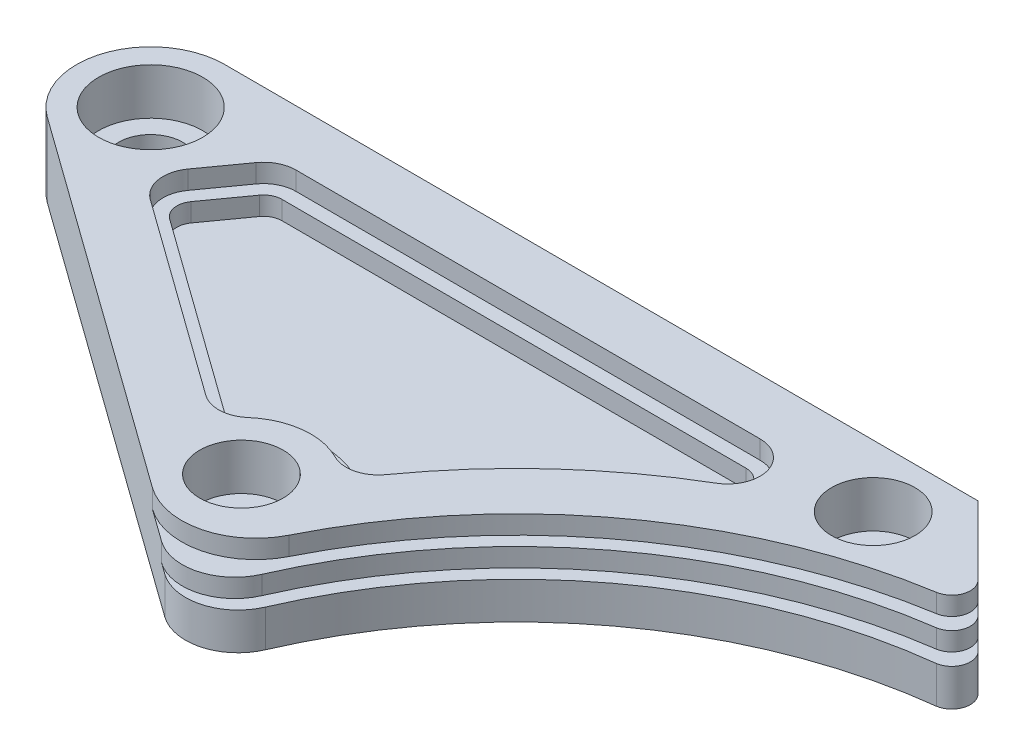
ISO-10303-21;
HEADER;
FILE_DESCRIPTION(('STEP AP214'),'2;1');
FILE_NAME('part.step','',(''),(''),'','','');
FILE_SCHEMA(('AUTOMOTIVE_DESIGN { 1 0 10303 214 1 1 1 1 }'));
ENDSEC;
DATA;
#1=APPLICATION_CONTEXT('core data for automotive mechanical design processes');
#2=APPLICATION_PROTOCOL_DEFINITION('international standard','automotive_design',2000,#1);
#3=PRODUCT_CONTEXT('',#1,'mechanical');
#4=PRODUCT('Part','Part','',(#3));
#5=PRODUCT_RELATED_PRODUCT_CATEGORY('part','',(#4));
#6=PRODUCT_DEFINITION_FORMATION('','',#4);
#7=PRODUCT_DEFINITION_CONTEXT('part definition',#1,'design');
#8=PRODUCT_DEFINITION('design','',#6,#7);
#9=PRODUCT_DEFINITION_SHAPE('','',#8);
#10=(LENGTH_UNIT() NAMED_UNIT(*) SI_UNIT(.MILLI.,.METRE.));
#11=(NAMED_UNIT(*) PLANE_ANGLE_UNIT() SI_UNIT($,.RADIAN.));
#12=(NAMED_UNIT(*) SI_UNIT($,.STERADIAN.) SOLID_ANGLE_UNIT());
#13=UNCERTAINTY_MEASURE_WITH_UNIT(LENGTH_MEASURE(1.E-05),#10,'distance_accuracy_value','');
#14=(GEOMETRIC_REPRESENTATION_CONTEXT(3) GLOBAL_UNCERTAINTY_ASSIGNED_CONTEXT((#13)) GLOBAL_UNIT_ASSIGNED_CONTEXT((#10,
#11,#12)) REPRESENTATION_CONTEXT('',''));
#15=CARTESIAN_POINT('',(0.,0.,0.));
#16=DIRECTION('',(0.,0.,1.));
#17=DIRECTION('',(1.,0.,0.));
#18=AXIS2_PLACEMENT_3D('',#15,#16,#17);
#19=CARTESIAN_POINT('',(0.,-22.198500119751,-19.0234751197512));
#20=DIRECTION('',(0.,1.,0.));
#21=DIRECTION('',(1.,0.,0.));
#22=AXIS2_PLACEMENT_3D('',#19,#20,#21);
#23=CYLINDRICAL_SURFACE('',#22,12.7);
#24=CARTESIAN_POINT('',(0.,-19.023500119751,-19.0234751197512));
#25=DIRECTION('',(0.,1.,0.));
#26=DIRECTION('',(1.,0.,0.));
#27=AXIS2_PLACEMENT_3D('',#24,#25,#26);
#28=CIRCLE('',#27,12.7);
#29=CARTESIAN_POINT('',(0.021005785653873,-19.0235001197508,-31.7234577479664));
#30=VERTEX_POINT('',#29);
#31=CARTESIAN_POINT('',(-7.41110238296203,-19.0235001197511,-8.71010702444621));
#32=VERTEX_POINT('',#31);
#33=EDGE_CURVE('E490',#30,#32,#28,.T.);
#34=ORIENTED_EDGE('',*,*,#33,.F.);
#35=DIRECTION('',(0.,1.,0.));
#36=VECTOR('',#35,1.);
#37=CARTESIAN_POINT('',(0.021005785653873,-22.1985001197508,-31.7234577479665));
#38=LINE('',#37,#36);
#39=CARTESIAN_POINT('',(0.0210057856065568,-31.7235001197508,-31.7234577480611));
#40=VERTEX_POINT('',#39);
#41=EDGE_CURVE('E667',#40,#30,#38,.T.);
#42=ORIENTED_EDGE('',*,*,#41,.F.);
#43=CARTESIAN_POINT('',(-4.73736393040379E-11,-31.723500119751,-19.0234751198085));
#44=DIRECTION('',(0.,-1.,0.));
#45=DIRECTION('',(1.,0.,0.));
#46=AXIS2_PLACEMENT_3D('',#43,#44,#45);
#47=CIRCLE('',#46,12.7000000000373);
#48=CARTESIAN_POINT('',(-7.41110238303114,-31.7235001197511,-8.71010702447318));
#49=VERTEX_POINT('',#48);
#50=EDGE_CURVE('E358',#49,#40,#47,.T.);
#51=ORIENTED_EDGE('',*,*,#50,.F.);
#52=DIRECTION('',(0.,1.,0.));
#53=VECTOR('',#52,1.);
#54=CARTESIAN_POINT('',(-7.41110238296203,-22.1985001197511,-8.71010702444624));
#55=LINE('',#54,#53);
#56=EDGE_CURVE('E497',#49,#32,#55,.T.);
#57=ORIENTED_EDGE('',*,*,#56,.T.);
#58=EDGE_LOOP('',(#34,#42,#51,#57));
#59=FACE_BOUND('',#58,.T.);
#60=ADVANCED_FACE('F34',(#59),#23,.T.);
#61=CARTESIAN_POINT('',(129.351607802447,-22.1985001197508,-31.5095447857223));
#62=DIRECTION('',(0.0016539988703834,0.,-0.999998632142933));
#63=DIRECTION('',(-0.999998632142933,0.,-0.0016539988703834));
#64=AXIS2_PLACEMENT_3D('',#61,#62,#63);
#65=PLANE('',#64);
#66=DIRECTION('',(-0.999998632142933,0.,-0.0016539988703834));
#67=VECTOR('',#66,1.);
#68=CARTESIAN_POINT('',(129.351607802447,-19.0235001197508,-31.5095447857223));
#69=LINE('',#68,#67);
#70=CARTESIAN_POINT('',(129.351607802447,-19.0235001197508,-31.5095447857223));
#71=VERTEX_POINT('',#70);
#72=EDGE_CURVE('E665',#71,#30,#69,.T.);
#73=ORIENTED_EDGE('',*,*,#72,.F.);
#74=DIRECTION('',(0.,1.,0.));
#75=VECTOR('',#74,1.);
#76=CARTESIAN_POINT('',(129.351607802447,-22.1985001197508,-31.5095447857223));
#77=LINE('',#76,#75);
#78=CARTESIAN_POINT('',(129.351607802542,-31.7235001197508,-31.5095447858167));
#79=VERTEX_POINT('',#78);
#80=EDGE_CURVE('E670',#79,#71,#77,.T.);
#81=ORIENTED_EDGE('',*,*,#80,.F.);
#82=DIRECTION('',(0.999998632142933,0.,0.00165399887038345));
#83=VECTOR('',#82,1.);
#84=CARTESIAN_POINT('',(129.351607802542,-31.7235001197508,-31.5095447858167));
#85=LINE('',#84,#83);
#86=EDGE_CURVE('E361',#40,#79,#85,.T.);
#87=ORIENTED_EDGE('',*,*,#86,.F.);
#88=ORIENTED_EDGE('',*,*,#41,.T.);
#89=EDGE_LOOP('',(#73,#81,#87,#88));
#90=FACE_BOUND('',#89,.T.);
#91=ADVANCED_FACE('F546',(#90),#65,.T.);
#92=CARTESIAN_POINT('',(141.115295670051,-22.198500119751,-19.7458569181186));
#93=DIRECTION('',(0.707106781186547,0.,-0.707106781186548));
#94=DIRECTION('',(-0.707106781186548,0.,-0.707106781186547));
#95=AXIS2_PLACEMENT_3D('',#92,#93,#94);
#96=PLANE('',#95);
#97=DIRECTION('',(-0.707106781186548,0.,-0.707106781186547));
#98=VECTOR('',#97,1.);
#99=CARTESIAN_POINT('',(141.115295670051,-19.023500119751,-19.7458569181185));
#100=LINE('',#99,#98);
#101=CARTESIAN_POINT('',(141.115295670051,-19.023500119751,-19.7458569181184));
#102=VERTEX_POINT('',#101);
#103=EDGE_CURVE('E662',#102,#71,#100,.T.);
#104=ORIENTED_EDGE('',*,*,#103,.F.);
#105=DIRECTION('',(0.,1.,0.));
#106=VECTOR('',#105,1.);
#107=CARTESIAN_POINT('',(141.115295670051,-22.198500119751,-19.7458569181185));
#108=LINE('',#107,#106);
#109=CARTESIAN_POINT('',(141.115295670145,-22.198500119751,-19.745856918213));
#110=VERTEX_POINT('',#109);
#111=EDGE_CURVE('E672',#110,#102,#108,.T.);
#112=ORIENTED_EDGE('',*,*,#111,.F.);
#113=DIRECTION('',(0.707106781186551,0.,0.707106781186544));
#114=VECTOR('',#113,1.);
#115=CARTESIAN_POINT('',(143.208774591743,-22.198500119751,-17.6523779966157));
#116=LINE('',#115,#114);
#117=CARTESIAN_POINT('',(143.208774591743,-22.198500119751,-17.6523779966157));
#118=VERTEX_POINT('',#117);
#119=EDGE_CURVE('E474',#110,#118,#116,.T.);
#120=ORIENTED_EDGE('',*,*,#119,.T.);
#121=DIRECTION('',(0.,1.,0.));
#122=VECTOR('',#121,1.);
#123=CARTESIAN_POINT('',(143.208774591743,-25.373500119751,-17.6523779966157));
#124=LINE('',#123,#122);
#125=CARTESIAN_POINT('',(143.208774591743,-25.373500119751,-17.6523779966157));
#126=VERTEX_POINT('',#125);
#127=EDGE_CURVE('E501',#126,#118,#124,.T.);
#128=ORIENTED_EDGE('',*,*,#127,.F.);
#129=DIRECTION('',(0.707106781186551,0.,0.707106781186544));
#130=VECTOR('',#129,1.);
#131=CARTESIAN_POINT('',(145.336191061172,-25.373500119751,-15.524961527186));
#132=LINE('',#131,#130);
#133=CARTESIAN_POINT('',(145.336191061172,-25.373500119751,-15.524961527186));
#134=VERTEX_POINT('',#133);
#135=EDGE_CURVE('E378',#126,#134,#132,.T.);
#136=ORIENTED_EDGE('',*,*,#135,.T.);
#137=DIRECTION('',(0.,1.,0.));
#138=VECTOR('',#137,1.);
#139=CARTESIAN_POINT('',(145.336191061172,-31.723500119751,-15.5249615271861));
#140=LINE('',#139,#138);
#141=CARTESIAN_POINT('',(145.336191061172,-31.723500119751,-15.5249615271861));
#142=VERTEX_POINT('',#141);
#143=EDGE_CURVE('E518',#142,#134,#140,.T.);
#144=ORIENTED_EDGE('',*,*,#143,.F.);
#145=DIRECTION('',(0.707106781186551,0.,0.707106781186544));
#146=VECTOR('',#145,1.);
#147=CARTESIAN_POINT('',(145.336191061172,-31.723500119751,-15.5249615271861));
#148=LINE('',#147,#146);
#149=EDGE_CURVE('E364',#79,#142,#148,.T.);
#150=ORIENTED_EDGE('',*,*,#149,.F.);
#151=ORIENTED_EDGE('',*,*,#80,.T.);
#152=EDGE_LOOP('',(#104,#112,#120,#128,#136,#144,#150,#151));
#153=FACE_BOUND('',#152,.T.);
#154=ADVANCED_FACE('F552',(#153),#96,.T.);
#155=CARTESIAN_POINT('',(138.870231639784,-22.198500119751,-17.5007928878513));
#156=DIRECTION('',(0.,1.,0.));
#157=DIRECTION('',(1.,0.,0.));
#158=AXIS2_PLACEMENT_3D('',#155,#156,#157);
#159=CYLINDRICAL_SURFACE('',#158,3.17499999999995);
#160=CARTESIAN_POINT('',(138.870231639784,-19.023500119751,-17.5007928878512));
#161=DIRECTION('',(0.,1.,0.));
#162=DIRECTION('',(1.,0.,0.));
#163=AXIS2_PLACEMENT_3D('',#160,#161,#162);
#164=CIRCLE('',#163,3.17499999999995);
#165=CARTESIAN_POINT('',(139.373871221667,-19.023500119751,-14.3659927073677));
#166=VERTEX_POINT('',#165);
#167=EDGE_CURVE('E657',#166,#102,#164,.T.);
#168=ORIENTED_EDGE('',*,*,#167,.F.);
#169=DIRECTION('',(0.,1.,0.));
#170=VECTOR('',#169,1.);
#171=CARTESIAN_POINT('',(139.373871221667,-22.198500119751,-14.3659927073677));
#172=LINE('',#171,#170);
#173=CARTESIAN_POINT('',(139.373871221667,-22.198500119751,-14.3659927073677));
#174=VERTEX_POINT('',#173);
#175=EDGE_CURVE('E673',#174,#166,#172,.T.);
#176=ORIENTED_EDGE('',*,*,#175,.F.);
#177=CARTESIAN_POINT('',(138.870231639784,-22.198500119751,-17.5007928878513));
#178=DIRECTION('',(0.,1.,0.));
#179=DIRECTION('',(1.,0.,0.));
#180=AXIS2_PLACEMENT_3D('',#177,#178,#179);
#181=CIRCLE('',#180,3.17499999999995);
#182=EDGE_CURVE('E493',#174,#110,#181,.T.);
#183=ORIENTED_EDGE('',*,*,#182,.T.);
#184=ORIENTED_EDGE('',*,*,#111,.T.);
#185=EDGE_LOOP('',(#168,#176,#183,#184));
#186=FACE_BOUND('',#185,.T.);
#187=ADVANCED_FACE('F951',(#186),#159,.T.);
#188=CARTESIAN_POINT('',(153.161171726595,-22.1985001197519,71.4502013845));
#189=DIRECTION('',(0.,1.,0.));
#190=DIRECTION('',(1.,0.,0.));
#191=AXIS2_PLACEMENT_3D('',#188,#189,#190);
#192=CYLINDRICAL_SURFACE('',#191,86.9166774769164);
#193=CARTESIAN_POINT('',(153.161171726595,-19.0235001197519,71.4502013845));
#194=DIRECTION('',(0.,-1.,0.));
#195=DIRECTION('',(-1.,0.,0.));
#196=AXIS2_PLACEMENT_3D('',#193,#194,#195);
#197=CIRCLE('',#196,86.9166774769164);
#198=CARTESIAN_POINT('',(75.3851970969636,-19.0235001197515,32.6506318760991));
#199=VERTEX_POINT('',#198);
#200=EDGE_CURVE('E656',#199,#166,#197,.T.);
#201=ORIENTED_EDGE('',*,*,#200,.F.);
#202=DIRECTION('',(0.,1.,0.));
#203=VECTOR('',#202,1.);
#204=CARTESIAN_POINT('',(75.3851970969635,-22.1985001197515,32.6506318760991));
#205=LINE('',#204,#203);
#206=CARTESIAN_POINT('',(75.3851970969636,-22.1985001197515,32.6506318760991));
#207=VERTEX_POINT('',#206);
#208=EDGE_CURVE('E681',#199,#207,#205,.F.);
#209=ORIENTED_EDGE('',*,*,#208,.T.);
#210=CARTESIAN_POINT('',(153.161171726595,-22.1985001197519,71.4502013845));
#211=DIRECTION('',(0.,-1.,0.));
#212=DIRECTION('',(-1.,0.,0.));
#213=AXIS2_PLACEMENT_3D('',#210,#211,#212);
#214=CIRCLE('',#213,86.9166774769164);
#215=EDGE_CURVE('E498',#207,#174,#214,.T.);
#216=ORIENTED_EDGE('',*,*,#215,.T.);
#217=ORIENTED_EDGE('',*,*,#175,.T.);
#218=EDGE_LOOP('',(#201,#209,#216,#217));
#219=FACE_BOUND('',#218,.T.);
#220=ADVANCED_FACE('F945',(#219),#192,.F.);
#221=CARTESIAN_POINT('',(-7.41110238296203,-22.1985001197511,-8.71010702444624));
#222=DIRECTION('',(-0.583551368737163,0.,0.812076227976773));
#223=DIRECTION('',(0.812076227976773,0.,0.583551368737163));
#224=AXIS2_PLACEMENT_3D('',#221,#222,#223);
#225=PLANE('',#224);
#226=DIRECTION('',(-0.812076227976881,0.,-0.583551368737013));
#227=VECTOR('',#226,1.);
#228=CARTESIAN_POINT('',(-7.41110238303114,-31.7235001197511,-8.71010702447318));
#229=LINE('',#228,#227);
#230=CARTESIAN_POINT('',(64.1765343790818,-31.7235001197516,42.7321861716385));
#231=VERTEX_POINT('',#230);
#232=EDGE_CURVE('E355',#231,#49,#229,.T.);
#233=ORIENTED_EDGE('',*,*,#232,.F.);
#234=DIRECTION('',(0.,-1.,0.));
#235=VECTOR('',#234,1.);
#236=CARTESIAN_POINT('',(64.1765343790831,-25.3735001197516,42.7321861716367));
#237=LINE('',#236,#235);
#238=CARTESIAN_POINT('',(64.1765343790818,-25.3735001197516,42.7321861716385));
#239=VERTEX_POINT('',#238);
#240=EDGE_CURVE('E381',#231,#239,#237,.F.);
#241=ORIENTED_EDGE('',*,*,#240,.T.);
#242=DIRECTION('',(-0.812076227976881,0.,-0.583551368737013));
#243=VECTOR('',#242,1.);
#244=CARTESIAN_POINT('',(-7.41110238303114,-25.3735001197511,-8.71010702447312));
#245=LINE('',#244,#243);
#246=CARTESIAN_POINT('',(62.197655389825,-25.3735001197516,41.3101798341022));
#247=VERTEX_POINT('',#246);
#248=EDGE_CURVE('E370',#239,#247,#245,.T.);
#249=ORIENTED_EDGE('',*,*,#248,.T.);
#250=DIRECTION('',(0.,-1.,0.));
#251=VECTOR('',#250,1.);
#252=CARTESIAN_POINT('',(62.1976553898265,-22.1985001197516,41.3101798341));
#253=LINE('',#252,#251);
#254=CARTESIAN_POINT('',(62.1976553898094,-22.1985001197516,41.3101798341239));
#255=VERTEX_POINT('',#254);
#256=EDGE_CURVE('E467',#247,#255,#253,.F.);
#257=ORIENTED_EDGE('',*,*,#256,.T.);
#258=DIRECTION('',(-0.812076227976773,0.,-0.583551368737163));
#259=VECTOR('',#258,1.);
#260=CARTESIAN_POINT('',(-7.41110238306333,-22.1985001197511,-8.71010702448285));
#261=LINE('',#260,#259);
#262=CARTESIAN_POINT('',(56.6097063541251,-22.1985001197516,37.2947251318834));
#263=VERTEX_POINT('',#262);
#264=EDGE_CURVE('E471',#255,#263,#261,.T.);
#265=ORIENTED_EDGE('',*,*,#264,.T.);
#266=DIRECTION('',(0.,1.,0.));
#267=VECTOR('',#266,1.);
#268=CARTESIAN_POINT('',(56.6097063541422,-22.1985001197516,37.2947251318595));
#269=LINE('',#268,#267);
#270=CARTESIAN_POINT('',(56.6097063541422,-19.0235001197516,37.2947251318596));
#271=VERTEX_POINT('',#270);
#272=EDGE_CURVE('E669',#263,#271,#269,.T.);
#273=ORIENTED_EDGE('',*,*,#272,.T.);
#274=DIRECTION('',(0.812076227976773,0.,0.583551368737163));
#275=VECTOR('',#274,1.);
#276=CARTESIAN_POINT('',(-7.41110238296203,-19.0235001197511,-8.71010702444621));
#277=LINE('',#276,#275);
#278=EDGE_CURVE('E650',#32,#271,#277,.T.);
#279=ORIENTED_EDGE('',*,*,#278,.F.);
#280=ORIENTED_EDGE('',*,*,#56,.F.);
#281=EDGE_LOOP('',(#233,#241,#249,#257,#265,#273,#279,#280));
#282=FACE_BOUND('',#281,.T.);
#283=ADVANCED_FACE('F558',(#282),#225,.T.);
#284=CARTESIAN_POINT('',(0.,-19.023500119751,-19.0234751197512));
#285=DIRECTION('',(0.,1.,0.));
#286=DIRECTION('',(1.,0.,0.));
#287=AXIS2_PLACEMENT_3D('',#284,#285,#286);
#288=PLANE('',#287);
#289=CARTESIAN_POINT('',(0.,-19.023500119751,-19.0234751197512));
#290=DIRECTION('',(0.,1.,0.));
#291=DIRECTION('',(1.,0.,0.));
#292=AXIS2_PLACEMENT_3D('',#289,#290,#291);
#293=CIRCLE('',#292,8.92875);
#294=CARTESIAN_POINT('',(8.92875,-19.023500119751,-19.0234751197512));
#295=VERTEX_POINT('',#294);
#296=EDGE_CURVE('E1127',#295,#295,#293,.T.);
#297=ORIENTED_EDGE('',*,*,#296,.F.);
#298=EDGE_LOOP('',(#297));
#299=FACE_BOUND('',#298,.T.);
#300=CARTESIAN_POINT('',(62.2463908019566,-19.0235001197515,27.6611404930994));
#301=DIRECTION('',(0.,1.,0.));
#302=DIRECTION('',(1.,0.,0.));
#303=AXIS2_PLACEMENT_3D('',#300,#301,#302);
#304=CIRCLE('',#303,7.14375000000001);
#305=CARTESIAN_POINT('',(69.3901408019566,-19.0235001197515,27.6611404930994));
#306=VERTEX_POINT('',#305);
#307=EDGE_CURVE('E1137',#306,#306,#304,.T.);
#308=ORIENTED_EDGE('',*,*,#307,.F.);
#309=EDGE_LOOP('',(#308));
#310=FACE_BOUND('',#309,.T.);
#311=CARTESIAN_POINT('',(121.968512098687,-19.0235001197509,-20.9321282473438));
#312=DIRECTION('',(0.,1.,0.));
#313=DIRECTION('',(1.,0.,0.));
#314=AXIS2_PLACEMENT_3D('',#311,#312,#313);
#315=CIRCLE('',#314,7.14375000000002);
#316=CARTESIAN_POINT('',(129.112262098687,-19.0235001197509,-20.9321282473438));
#317=VERTEX_POINT('',#316);
#318=EDGE_CURVE('E1149',#317,#317,#315,.T.);
#319=ORIENTED_EDGE('',*,*,#318,.F.);
#320=EDGE_LOOP('',(#319));
#321=FACE_BOUND('',#320,.T.);
#322=DIRECTION('',(-0.583551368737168,0.,0.812076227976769));
#323=VECTOR('',#322,1.);
#324=CARTESIAN_POINT('',(18.9154394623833,-19.0235001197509,-22.1671933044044));
#325=LINE('',#324,#323);
#326=CARTESIAN_POINT('',(17.2496877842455,-19.023500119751,-19.8491157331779));
#327=VERTEX_POINT('',#326);
#328=CARTESIAN_POINT('',(12.3731929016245,-19.023500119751,-13.0629341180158));
#329=VERTEX_POINT('',#328);
#330=EDGE_CURVE('E312',#327,#329,#325,.T.);
#331=ORIENTED_EDGE('',*,*,#330,.F.);
#332=CARTESIAN_POINT('',(21.760754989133,-19.023500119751,-16.6074995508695));
#333=DIRECTION('',(0.,1.,0.));
#334=DIRECTION('',(1.,0.,0.));
#335=AXIS2_PLACEMENT_3D('',#332,#333,#334);
#336=CIRCLE('',#335,5.5549800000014);
#337=CARTESIAN_POINT('',(21.769942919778,-19.0235001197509,-22.1624719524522));
#338=VERTEX_POINT('',#337);
#339=EDGE_CURVE('E391',#327,#338,#336,.F.);
#340=ORIENTED_EDGE('',*,*,#339,.T.);
#341=DIRECTION('',(-0.999998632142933,0.,-0.00165399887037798));
#342=VECTOR('',#341,1.);
#343=CARTESIAN_POINT('',(101.475486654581,-19.0235001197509,-22.0306388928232));
#344=LINE('',#343,#342);
#345=CARTESIAN_POINT('',(101.475486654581,-19.0235001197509,-22.0306388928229));
#346=VERTEX_POINT('',#345);
#347=EDGE_CURVE('E318',#346,#338,#344,.T.);
#348=ORIENTED_EDGE('',*,*,#347,.F.);
#349=CARTESIAN_POINT('',(101.466298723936,-19.023500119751,-16.4756664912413));
#350=DIRECTION('',(0.,1.,0.));
#351=DIRECTION('',(1.,0.,0.));
#352=AXIS2_PLACEMENT_3D('',#349,#350,#351);
#353=CIRCLE('',#352,5.5549800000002);
#354=CARTESIAN_POINT('',(104.281724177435,-19.023500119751,-11.6870150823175));
#355=VERTEX_POINT('',#354);
#356=EDGE_CURVE('E343',#355,#346,#353,.T.);
#357=ORIENTED_EDGE('',*,*,#356,.F.);
#358=CARTESIAN_POINT('',(153.161171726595,-19.0235001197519,71.4502013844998));
#359=DIRECTION('',(0.,-1.,0.));
#360=DIRECTION('',(-1.,0.,0.));
#361=AXIS2_PLACEMENT_3D('',#358,#359,#360);
#362=CIRCLE('',#361,96.4416774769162);
#363=CARTESIAN_POINT('',(74.7171001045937,-19.0235001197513,15.3473959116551));
#364=VERTEX_POINT('',#363);
#365=EDGE_CURVE('E341',#364,#355,#362,.T.);
#366=ORIENTED_EDGE('',*,*,#365,.F.);
#367=CARTESIAN_POINT('',(70.1987708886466,-19.0235001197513,12.1159095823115));
#368=DIRECTION('',(0.,1.,0.));
#369=DIRECTION('',(1.,0.,0.));
#370=AXIS2_PLACEMENT_3D('',#367,#368,#369);
#371=CIRCLE('',#370,5.5549800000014);
#372=CARTESIAN_POINT('',(67.6688624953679,-19.0235001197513,17.061348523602));
#373=VERTEX_POINT('',#372);
#374=EDGE_CURVE('E379',#364,#373,#371,.F.);
#375=ORIENTED_EDGE('',*,*,#374,.T.);
#376=CARTESIAN_POINT('',(62.2463908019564,-19.0235001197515,27.6611404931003));
#377=DIRECTION('',(0.,-1.,0.));
#378=DIRECTION('',(-1.,0.,0.));
#379=AXIS2_PLACEMENT_3D('',#376,#377,#378);
#380=CIRCLE('',#379,11.9062499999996);
#381=CARTESIAN_POINT('',(54.4091819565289,-19.0235001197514,18.6980524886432));
#382=VERTEX_POINT('',#381);
#383=EDGE_CURVE('E338',#382,#373,#380,.T.);
#384=ORIENTED_EDGE('',*,*,#383,.F.);
#385=CARTESIAN_POINT('',(50.7526537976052,-19.0235001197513,14.5162341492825));
#386=DIRECTION('',(0.,1.,0.));
#387=DIRECTION('',(1.,0.,0.));
#388=AXIS2_PLACEMENT_3D('',#385,#386,#387);
#389=CIRCLE('',#388,5.5549800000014);
#390=CARTESIAN_POINT('',(47.5110376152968,-19.0235001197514,19.02730135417));
#391=VERTEX_POINT('',#390);
#392=EDGE_CURVE('E394',#382,#391,#389,.F.);
#393=ORIENTED_EDGE('',*,*,#392,.T.);
#394=DIRECTION('',(0.812076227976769,0.,0.583551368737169));
#395=VECTOR('',#394,1.);
#396=CARTESIAN_POINT('',(9.13157671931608,-19.0235001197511,-8.55186691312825));
#397=LINE('',#396,#395);
#398=CARTESIAN_POINT('',(13.6426439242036,-19.0235001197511,-5.31025073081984));
#399=VERTEX_POINT('',#398);
#400=EDGE_CURVE('E335',#399,#391,#397,.T.);
#401=ORIENTED_EDGE('',*,*,#400,.F.);
#402=CARTESIAN_POINT('',(16.884260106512,-19.0235001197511,-9.82131793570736));
#403=DIRECTION('',(0.,1.,0.));
#404=DIRECTION('',(1.,0.,0.));
#405=AXIS2_PLACEMENT_3D('',#402,#403,#404);
#406=CIRCLE('',#405,5.5549800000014);
#407=EDGE_CURVE('E387',#399,#329,#406,.F.);
#408=ORIENTED_EDGE('',*,*,#407,.T.);
#409=EDGE_LOOP('',(#331,#340,#348,#357,#366,#375,#384,#393,#401,#408));
#410=FACE_BOUND('',#409,.T.);
#411=ORIENTED_EDGE('',*,*,#278,.T.);
#412=CARTESIAN_POINT('',(64.0208087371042,-19.0235001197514,26.9813570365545));
#413=DIRECTION('',(0.,1.,0.));
#414=DIRECTION('',(1.,0.,0.));
#415=AXIS2_PLACEMENT_3D('',#412,#413,#414);
#416=CIRCLE('',#415,12.7);
#417=EDGE_CURVE('E651',#271,#199,#416,.T.);
#418=ORIENTED_EDGE('',*,*,#417,.T.);
#419=ORIENTED_EDGE('',*,*,#200,.T.);
#420=ORIENTED_EDGE('',*,*,#167,.T.);
#421=ORIENTED_EDGE('',*,*,#103,.T.);
#422=ORIENTED_EDGE('',*,*,#72,.T.);
#423=ORIENTED_EDGE('',*,*,#33,.T.);
#424=EDGE_LOOP('',(#411,#418,#419,#420,#421,#422,#423));
#425=FACE_BOUND('',#424,.T.);
#426=ADVANCED_FACE('F641',(#299,#310,#321,#410,#425),#288,.T.);
#427=CARTESIAN_POINT('',(153.161171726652,-22.1985001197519,71.4502013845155));
#428=DIRECTION('',(0.,-1.,0.));
#429=DIRECTION('',(-1.,0.,0.));
#430=AXIS2_PLACEMENT_3D('',#427,#428,#429);
#431=PLANE('',#430);
#432=ORIENTED_EDGE('',*,*,#264,.F.);
#433=CARTESIAN_POINT('',(67.449617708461,-22.1985001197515,34.0014937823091));
#434=DIRECTION('',(0.,-1.,0.));
#435=DIRECTION('',(-1.,0.,0.));
#436=AXIS2_PLACEMENT_3D('',#433,#434,#435);
#437=CIRCLE('',#436,9.);
#438=CARTESIAN_POINT('',(75.6968028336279,-22.1985001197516,37.604816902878));
#439=VERTEX_POINT('',#438);
#440=EDGE_CURVE('E465',#255,#439,#437,.F.);
#441=ORIENTED_EDGE('',*,*,#440,.T.);
#442=CARTESIAN_POINT('',(153.161171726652,-22.1985001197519,71.4502013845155));
#443=DIRECTION('',(0.,1.,0.));
#444=DIRECTION('',(-1.,0.,0.));
#445=AXIS2_PLACEMENT_3D('',#442,#443,#444);
#446=CIRCLE('',#445,84.5354274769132);
#447=CARTESIAN_POINT('',(141.467350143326,-22.198500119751,-12.2725137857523));
#448=VERTEX_POINT('',#447);
#449=EDGE_CURVE('E475',#448,#439,#446,.T.);
#450=ORIENTED_EDGE('',*,*,#449,.F.);
#451=CARTESIAN_POINT('',(140.963710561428,-22.198500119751,-15.4073139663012));
#452=DIRECTION('',(0.,-1.,0.));
#453=DIRECTION('',(1.,0.,0.));
#454=AXIS2_PLACEMENT_3D('',#451,#452,#453);
#455=CIRCLE('',#454,3.17500000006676);
#456=EDGE_CURVE('E483',#118,#448,#455,.T.);
#457=ORIENTED_EDGE('',*,*,#456,.F.);
#458=ORIENTED_EDGE('',*,*,#119,.F.);
#459=ORIENTED_EDGE('',*,*,#182,.F.);
#460=ORIENTED_EDGE('',*,*,#215,.F.);
#461=CARTESIAN_POINT('',(64.0208087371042,-22.1985001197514,26.9813570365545));
#462=DIRECTION('',(0.,-1.,0.));
#463=DIRECTION('',(-1.,0.,0.));
#464=AXIS2_PLACEMENT_3D('',#461,#462,#463);
#465=CIRCLE('',#464,12.7);
#466=EDGE_CURVE('E470',#207,#263,#465,.T.);
#467=ORIENTED_EDGE('',*,*,#466,.T.);
#468=EDGE_LOOP('',(#432,#441,#450,#457,#458,#459,#460,#467));
#469=FACE_BOUND('',#468,.T.);
#470=ADVANCED_FACE('F644',(#469),#431,.F.);
#471=CARTESIAN_POINT('',(153.161171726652,-25.3735001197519,71.4502013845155));
#472=DIRECTION('',(0.,1.,0.));
#473=DIRECTION('',(1.,0.,0.));
#474=AXIS2_PLACEMENT_3D('',#471,#472,#473);
#475=CYLINDRICAL_SURFACE('',#474,84.5354274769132);
#476=ORIENTED_EDGE('',*,*,#449,.T.);
#477=DIRECTION('',(0.,1.,0.));
#478=VECTOR('',#477,1.);
#479=CARTESIAN_POINT('',(75.6968028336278,-25.3735001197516,37.6048169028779));
#480=LINE('',#479,#478);
#481=CARTESIAN_POINT('',(75.6968028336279,-25.3735001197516,37.6048169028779));
#482=VERTEX_POINT('',#481);
#483=EDGE_CURVE('E463',#439,#482,#480,.F.);
#484=ORIENTED_EDGE('',*,*,#483,.T.);
#485=CARTESIAN_POINT('',(153.161171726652,-25.3735001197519,71.4502013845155));
#486=DIRECTION('',(0.,1.,0.));
#487=DIRECTION('',(-1.,0.,0.));
#488=AXIS2_PLACEMENT_3D('',#485,#486,#487);
#489=CIRCLE('',#488,84.5354274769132);
#490=CARTESIAN_POINT('',(141.467350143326,-25.373500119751,-12.2725137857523));
#491=VERTEX_POINT('',#490);
#492=EDGE_CURVE('E509',#491,#482,#489,.T.);
#493=ORIENTED_EDGE('',*,*,#492,.F.);
#494=DIRECTION('',(0.,1.,0.));
#495=VECTOR('',#494,1.);
#496=CARTESIAN_POINT('',(141.467350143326,-25.373500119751,-12.2725137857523));
#497=LINE('',#496,#495);
#498=EDGE_CURVE('E487',#491,#448,#497,.T.);
#499=ORIENTED_EDGE('',*,*,#498,.T.);
#500=EDGE_LOOP('',(#476,#484,#493,#499));
#501=FACE_BOUND('',#500,.T.);
#502=ADVANCED_FACE('F959',(#501),#475,.F.);
#503=CARTESIAN_POINT('',(140.963710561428,-25.373500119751,-15.4073139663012));
#504=DIRECTION('',(0.,1.,0.));
#505=DIRECTION('',(1.,0.,0.));
#506=AXIS2_PLACEMENT_3D('',#503,#504,#505);
#507=CYLINDRICAL_SURFACE('',#506,3.17500000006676);
#508=ORIENTED_EDGE('',*,*,#456,.T.);
#509=ORIENTED_EDGE('',*,*,#498,.F.);
#510=CARTESIAN_POINT('',(140.963710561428,-25.373500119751,-15.4073139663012));
#511=DIRECTION('',(0.,-1.,0.));
#512=DIRECTION('',(1.,0.,0.));
#513=AXIS2_PLACEMENT_3D('',#510,#511,#512);
#514=CIRCLE('',#513,3.17500000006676);
#515=EDGE_CURVE('E506',#126,#491,#514,.T.);
#516=ORIENTED_EDGE('',*,*,#515,.F.);
#517=ORIENTED_EDGE('',*,*,#127,.T.);
#518=EDGE_LOOP('',(#508,#509,#516,#517));
#519=FACE_BOUND('',#518,.T.);
#520=ADVANCED_FACE('F969',(#519),#507,.T.);
#521=CARTESIAN_POINT('',(153.161171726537,-31.7235001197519,71.4502013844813));
#522=DIRECTION('',(0.,1.,0.));
#523=DIRECTION('',(1.,0.,0.));
#524=AXIS2_PLACEMENT_3D('',#521,#522,#523);
#525=CYLINDRICAL_SURFACE('',#524,82.1541774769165);
#526=CARTESIAN_POINT('',(153.161171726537,-25.3735001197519,71.4502013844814));
#527=DIRECTION('',(0.,1.,0.));
#528=DIRECTION('',(-1.,0.,0.));
#529=AXIS2_PLACEMENT_3D('',#526,#527,#528);
#530=CIRCLE('',#529,82.1541774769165);
#531=CARTESIAN_POINT('',(143.594766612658,-25.3735001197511,-10.1450973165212));
#532=VERTEX_POINT('',#531);
#533=CARTESIAN_POINT('',(77.6957434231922,-25.3735001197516,38.9805538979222));
#534=VERTEX_POINT('',#533);
#535=EDGE_CURVE('E350',#532,#534,#530,.T.);
#536=ORIENTED_EDGE('',*,*,#535,.T.);
#537=DIRECTION('',(0.,1.,0.));
#538=VECTOR('',#537,1.);
#539=CARTESIAN_POINT('',(77.6957434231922,-31.7235001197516,38.9805538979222));
#540=LINE('',#539,#538);
#541=CARTESIAN_POINT('',(77.6957434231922,-31.7235001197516,38.9805538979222));
#542=VERTEX_POINT('',#541);
#543=EDGE_CURVE('E42',#534,#542,#540,.F.);
#544=ORIENTED_EDGE('',*,*,#543,.T.);
#545=CARTESIAN_POINT('',(153.161171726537,-31.7235001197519,71.4502013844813));
#546=DIRECTION('',(0.,1.,0.));
#547=DIRECTION('',(-1.,0.,0.));
#548=AXIS2_PLACEMENT_3D('',#545,#546,#547);
#549=CIRCLE('',#548,82.1541774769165);
#550=CARTESIAN_POINT('',(143.594766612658,-31.7235001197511,-10.1450973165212));
#551=VERTEX_POINT('',#550);
#552=EDGE_CURVE('E353',#551,#542,#549,.T.);
#553=ORIENTED_EDGE('',*,*,#552,.F.);
#554=DIRECTION('',(0.,1.,0.));
#555=VECTOR('',#554,1.);
#556=CARTESIAN_POINT('',(143.594766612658,-31.7235001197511,-10.1450973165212));
#557=LINE('',#556,#555);
#558=EDGE_CURVE('E368',#551,#532,#557,.T.);
#559=ORIENTED_EDGE('',*,*,#558,.T.);
#560=EDGE_LOOP('',(#536,#544,#553,#559));
#561=FACE_BOUND('',#560,.T.);
#562=ADVANCED_FACE('F529',(#561),#525,.F.);
#563=CARTESIAN_POINT('',(143.091127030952,-31.723500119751,-13.279897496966));
#564=DIRECTION('',(0.,1.,0.));
#565=DIRECTION('',(1.,0.,0.));
#566=AXIS2_PLACEMENT_3D('',#563,#564,#565);
#567=CYLINDRICAL_SURFACE('',#566,3.17499999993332);
#568=CARTESIAN_POINT('',(143.091127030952,-25.373500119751,-13.2798974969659));
#569=DIRECTION('',(0.,-1.,0.));
#570=DIRECTION('',(1.,0.,0.));
#571=AXIS2_PLACEMENT_3D('',#568,#569,#570);
#572=CIRCLE('',#571,3.17499999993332);
#573=EDGE_CURVE('E356',#134,#532,#572,.T.);
#574=ORIENTED_EDGE('',*,*,#573,.T.);
#575=ORIENTED_EDGE('',*,*,#558,.F.);
#576=CARTESIAN_POINT('',(143.091127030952,-31.723500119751,-13.279897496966));
#577=DIRECTION('',(0.,-1.,0.));
#578=DIRECTION('',(1.,0.,0.));
#579=AXIS2_PLACEMENT_3D('',#576,#577,#578);
#580=CIRCLE('',#579,3.17499999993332);
#581=EDGE_CURVE('E366',#142,#551,#580,.T.);
#582=ORIENTED_EDGE('',*,*,#581,.F.);
#583=ORIENTED_EDGE('',*,*,#143,.T.);
#584=EDGE_LOOP('',(#574,#575,#582,#583));
#585=FACE_BOUND('',#584,.T.);
#586=ADVANCED_FACE('F525',(#585),#567,.T.);
#587=CARTESIAN_POINT('',(153.161171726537,-31.7235001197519,71.4502013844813));
#588=DIRECTION('',(0.,-1.,0.));
#589=DIRECTION('',(-1.,0.,0.));
#590=AXIS2_PLACEMENT_3D('',#587,#588,#589);
#591=PLANE('',#590);
#592=CARTESIAN_POINT('',(0.,-31.723500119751,-19.0234751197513));
#593=DIRECTION('',(0.,1.,0.));
#594=DIRECTION('',(1.,0.,0.));
#595=AXIS2_PLACEMENT_3D('',#592,#593,#594);
#596=CIRCLE('',#595,5.49910000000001);
#597=CARTESIAN_POINT('',(5.49910000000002,-31.723500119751,-19.0234751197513));
#598=VERTEX_POINT('',#597);
#599=EDGE_CURVE('E1134',#598,#598,#596,.T.);
#600=ORIENTED_EDGE('',*,*,#599,.T.);
#601=EDGE_LOOP('',(#600));
#602=FACE_BOUND('',#601,.T.);
#603=CARTESIAN_POINT('',(62.2463908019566,-31.7235001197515,27.6611404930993));
#604=DIRECTION('',(0.,1.,0.));
#605=DIRECTION('',(1.,0.,0.));
#606=AXIS2_PLACEMENT_3D('',#603,#604,#605);
#607=CIRCLE('',#606,3.96875000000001);
#608=CARTESIAN_POINT('',(66.2151408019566,-31.7235001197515,27.6611404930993));
#609=VERTEX_POINT('',#608);
#610=EDGE_CURVE('E1146',#609,#609,#607,.T.);
#611=ORIENTED_EDGE('',*,*,#610,.T.);
#612=EDGE_LOOP('',(#611));
#613=FACE_BOUND('',#612,.T.);
#614=CARTESIAN_POINT('',(121.968512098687,-31.7235001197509,-20.9321282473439));
#615=DIRECTION('',(0.,1.,0.));
#616=DIRECTION('',(1.,0.,0.));
#617=AXIS2_PLACEMENT_3D('',#614,#615,#616);
#618=CIRCLE('',#617,3.96875000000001);
#619=CARTESIAN_POINT('',(125.937262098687,-31.7235001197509,-20.9321282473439));
#620=VERTEX_POINT('',#619);
#621=EDGE_CURVE('E301',#620,#620,#618,.T.);
#622=ORIENTED_EDGE('',*,*,#621,.T.);
#623=EDGE_LOOP('',(#622));
#624=FACE_BOUND('',#623,.T.);
#625=ORIENTED_EDGE('',*,*,#552,.T.);
#626=CARTESIAN_POINT('',(69.4284966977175,-31.7235001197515,35.4235001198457));
#627=DIRECTION('',(0.,-1.,0.));
#628=DIRECTION('',(-1.,0.,0.));
#629=AXIS2_PLACEMENT_3D('',#626,#627,#628);
#630=CIRCLE('',#629,9.);
#631=EDGE_CURVE('E11',#542,#231,#630,.T.);
#632=ORIENTED_EDGE('',*,*,#631,.T.);
#633=ORIENTED_EDGE('',*,*,#232,.T.);
#634=ORIENTED_EDGE('',*,*,#50,.T.);
#635=ORIENTED_EDGE('',*,*,#86,.T.);
#636=ORIENTED_EDGE('',*,*,#149,.T.);
#637=ORIENTED_EDGE('',*,*,#581,.T.);
#638=EDGE_LOOP('',(#625,#632,#633,#634,#635,#636,#637));
#639=FACE_BOUND('',#638,.T.);
#640=ADVANCED_FACE('F533',(#602,#613,#624,#639),#591,.T.);
#641=CARTESIAN_POINT('',(153.161171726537,-25.3735001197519,71.4502013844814));
#642=DIRECTION('',(0.,-1.,0.));
#643=DIRECTION('',(-1.,0.,0.));
#644=AXIS2_PLACEMENT_3D('',#641,#642,#643);
#645=PLANE('',#644);
#646=ORIENTED_EDGE('',*,*,#248,.F.);
#647=CARTESIAN_POINT('',(69.4284966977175,-25.3735001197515,35.4235001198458));
#648=DIRECTION('',(0.,-1.,0.));
#649=DIRECTION('',(-1.,0.,0.));
#650=AXIS2_PLACEMENT_3D('',#647,#648,#649);
#651=CIRCLE('',#650,9.);
#652=EDGE_CURVE('E56',#239,#534,#651,.F.);
#653=ORIENTED_EDGE('',*,*,#652,.T.);
#654=ORIENTED_EDGE('',*,*,#535,.F.);
#655=ORIENTED_EDGE('',*,*,#573,.F.);
#656=ORIENTED_EDGE('',*,*,#135,.F.);
#657=ORIENTED_EDGE('',*,*,#515,.T.);
#658=ORIENTED_EDGE('',*,*,#492,.T.);
#659=CARTESIAN_POINT('',(67.449617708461,-25.3735001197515,34.001493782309));
#660=DIRECTION('',(0.,-1.,0.));
#661=DIRECTION('',(-1.,0.,0.));
#662=AXIS2_PLACEMENT_3D('',#659,#660,#661);
#663=CIRCLE('',#662,9.);
#664=EDGE_CURVE('E460',#482,#247,#663,.T.);
#665=ORIENTED_EDGE('',*,*,#664,.T.);
#666=EDGE_LOOP('',(#646,#653,#654,#655,#656,#657,#658,#665));
#667=FACE_BOUND('',#666,.T.);
#668=ADVANCED_FACE('F530',(#667),#645,.F.);
#669=CARTESIAN_POINT('',(18.9154394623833,-22.1985001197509,-22.1671933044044));
#670=DIRECTION('',(-0.812076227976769,0.,-0.583551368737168));
#671=DIRECTION('',(-0.583551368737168,0.,0.812076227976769));
#672=AXIS2_PLACEMENT_3D('',#669,#670,#671);
#673=PLANE('',#672);
#674=DIRECTION('',(-0.583551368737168,0.,0.812076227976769));
#675=VECTOR('',#674,1.);
#676=CARTESIAN_POINT('',(18.9154394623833,-22.1985001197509,-22.1671933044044));
#677=LINE('',#676,#675);
#678=CARTESIAN_POINT('',(17.2496877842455,-22.198500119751,-19.8491157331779));
#679=VERTEX_POINT('',#678);
#680=CARTESIAN_POINT('',(12.3731929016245,-22.198500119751,-13.0629341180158));
#681=VERTEX_POINT('',#680);
#682=EDGE_CURVE('E314',#679,#681,#677,.T.);
#683=ORIENTED_EDGE('',*,*,#682,.F.);
#684=DIRECTION('',(0.,1.,0.));
#685=VECTOR('',#684,1.);
#686=CARTESIAN_POINT('',(17.2496877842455,-19.023500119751,-19.8491157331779));
#687=LINE('',#686,#685);
#688=EDGE_CURVE('E403',#679,#327,#687,.T.);
#689=ORIENTED_EDGE('',*,*,#688,.T.);
#690=ORIENTED_EDGE('',*,*,#330,.T.);
#691=DIRECTION('',(0.,1.,0.));
#692=VECTOR('',#691,1.);
#693=CARTESIAN_POINT('',(12.3731929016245,-22.198500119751,-13.0629341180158));
#694=LINE('',#693,#692);
#695=EDGE_CURVE('E406',#329,#681,#694,.F.);
#696=ORIENTED_EDGE('',*,*,#695,.T.);
#697=EDGE_LOOP('',(#683,#689,#690,#696));
#698=FACE_BOUND('',#697,.T.);
#699=ADVANCED_FACE('F532',(#698),#673,.F.);
#700=CARTESIAN_POINT('',(101.475486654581,-22.1985001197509,-22.0306388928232));
#701=DIRECTION('',(0.00165399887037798,0.,-0.999998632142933));
#702=DIRECTION('',(-0.999998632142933,0.,-0.00165399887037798));
#703=AXIS2_PLACEMENT_3D('',#700,#701,#702);
#704=PLANE('',#703);
#705=ORIENTED_EDGE('',*,*,#347,.T.);
#706=DIRECTION('',(0.,1.,0.));
#707=VECTOR('',#706,1.);
#708=CARTESIAN_POINT('',(21.769942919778,-22.1985001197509,-22.1624719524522));
#709=LINE('',#708,#707);
#710=CARTESIAN_POINT('',(21.769942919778,-22.1985001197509,-22.1624719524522));
#711=VERTEX_POINT('',#710);
#712=EDGE_CURVE('E401',#338,#711,#709,.F.);
#713=ORIENTED_EDGE('',*,*,#712,.T.);
#714=DIRECTION('',(-0.999998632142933,0.,-0.00165399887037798));
#715=VECTOR('',#714,1.);
#716=CARTESIAN_POINT('',(101.475486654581,-22.1985001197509,-22.0306388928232));
#717=LINE('',#716,#715);
#718=CARTESIAN_POINT('',(101.475486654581,-22.1985001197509,-22.0306388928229));
#719=VERTEX_POINT('',#718);
#720=EDGE_CURVE('E329',#719,#711,#717,.T.);
#721=ORIENTED_EDGE('',*,*,#720,.F.);
#722=DIRECTION('',(0.,1.,0.));
#723=VECTOR('',#722,1.);
#724=CARTESIAN_POINT('',(101.475486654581,-22.1985001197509,-22.0306388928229));
#725=LINE('',#724,#723);
#726=EDGE_CURVE('E348',#719,#346,#725,.T.);
#727=ORIENTED_EDGE('',*,*,#726,.T.);
#728=EDGE_LOOP('',(#705,#713,#721,#727));
#729=FACE_BOUND('',#728,.T.);
#730=ADVANCED_FACE('F539',(#729),#704,.F.);
#731=CARTESIAN_POINT('',(101.466298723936,-22.198500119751,-16.4756664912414));
#732=DIRECTION('',(0.,1.,0.));
#733=DIRECTION('',(1.,0.,0.));
#734=AXIS2_PLACEMENT_3D('',#731,#732,#733);
#735=CYLINDRICAL_SURFACE('',#734,5.5549800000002);
#736=ORIENTED_EDGE('',*,*,#356,.T.);
#737=ORIENTED_EDGE('',*,*,#726,.F.);
#738=CARTESIAN_POINT('',(101.466298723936,-22.198500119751,-16.4756664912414));
#739=DIRECTION('',(0.,1.,0.));
#740=DIRECTION('',(1.,0.,0.));
#741=AXIS2_PLACEMENT_3D('',#738,#739,#740);
#742=CIRCLE('',#741,5.5549800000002);
#743=CARTESIAN_POINT('',(104.281724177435,-22.198500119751,-11.6870150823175));
#744=VERTEX_POINT('',#743);
#745=EDGE_CURVE('E326',#744,#719,#742,.T.);
#746=ORIENTED_EDGE('',*,*,#745,.F.);
#747=DIRECTION('',(0.,1.,0.));
#748=VECTOR('',#747,1.);
#749=CARTESIAN_POINT('',(104.281724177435,-22.198500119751,-11.6870150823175));
#750=LINE('',#749,#748);
#751=EDGE_CURVE('E332',#744,#355,#750,.T.);
#752=ORIENTED_EDGE('',*,*,#751,.T.);
#753=EDGE_LOOP('',(#736,#737,#746,#752));
#754=FACE_BOUND('',#753,.T.);
#755=ADVANCED_FACE('F622',(#754),#735,.F.);
#756=CARTESIAN_POINT('',(153.161171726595,-22.1985001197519,71.4502013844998));
#757=DIRECTION('',(0.,1.,0.));
#758=DIRECTION('',(1.,0.,0.));
#759=AXIS2_PLACEMENT_3D('',#756,#757,#758);
#760=CYLINDRICAL_SURFACE('',#759,96.4416774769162);
#761=CARTESIAN_POINT('',(153.161171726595,-22.1985001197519,71.4502013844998));
#762=DIRECTION('',(0.,-1.,0.));
#763=DIRECTION('',(-1.,0.,0.));
#764=AXIS2_PLACEMENT_3D('',#761,#762,#763);
#765=CIRCLE('',#764,96.4416774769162);
#766=CARTESIAN_POINT('',(74.7171001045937,-22.1985001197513,15.3473959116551));
#767=VERTEX_POINT('',#766);
#768=EDGE_CURVE('E324',#767,#744,#765,.T.);
#769=ORIENTED_EDGE('',*,*,#768,.F.);
#770=DIRECTION('',(0.,1.,0.));
#771=VECTOR('',#770,1.);
#772=CARTESIAN_POINT('',(74.7171001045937,-22.1985001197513,15.3473959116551));
#773=LINE('',#772,#771);
#774=EDGE_CURVE('E398',#767,#364,#773,.T.);
#775=ORIENTED_EDGE('',*,*,#774,.T.);
#776=ORIENTED_EDGE('',*,*,#365,.T.);
#777=ORIENTED_EDGE('',*,*,#751,.F.);
#778=EDGE_LOOP('',(#769,#775,#776,#777));
#779=FACE_BOUND('',#778,.T.);
#780=ADVANCED_FACE('F618',(#779),#760,.T.);
#781=CARTESIAN_POINT('',(62.2463908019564,-22.1985001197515,27.6611404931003));
#782=DIRECTION('',(0.,1.,0.));
#783=DIRECTION('',(1.,0.,0.));
#784=AXIS2_PLACEMENT_3D('',#781,#782,#783);
#785=CYLINDRICAL_SURFACE('',#784,11.9062499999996);
#786=CARTESIAN_POINT('',(62.2463908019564,-22.1985001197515,27.6611404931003));
#787=DIRECTION('',(0.,-1.,0.));
#788=DIRECTION('',(-1.,0.,0.));
#789=AXIS2_PLACEMENT_3D('',#786,#787,#788);
#790=CIRCLE('',#789,11.9062499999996);
#791=CARTESIAN_POINT('',(54.4091819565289,-22.1985001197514,18.6980524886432));
#792=VERTEX_POINT('',#791);
#793=CARTESIAN_POINT('',(67.6688624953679,-22.1985001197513,17.061348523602));
#794=VERTEX_POINT('',#793);
#795=EDGE_CURVE('E321',#792,#794,#790,.T.);
#796=ORIENTED_EDGE('',*,*,#795,.F.);
#797=DIRECTION('',(0.,1.,0.));
#798=VECTOR('',#797,1.);
#799=CARTESIAN_POINT('',(54.4091819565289,-22.1985001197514,18.6980524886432));
#800=LINE('',#799,#798);
#801=EDGE_CURVE('E421',#792,#382,#800,.T.);
#802=ORIENTED_EDGE('',*,*,#801,.T.);
#803=ORIENTED_EDGE('',*,*,#383,.T.);
#804=DIRECTION('',(0.,1.,0.));
#805=VECTOR('',#804,1.);
#806=CARTESIAN_POINT('',(67.6688624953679,-22.1985001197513,17.061348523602));
#807=LINE('',#806,#805);
#808=EDGE_CURVE('E424',#373,#794,#807,.F.);
#809=ORIENTED_EDGE('',*,*,#808,.T.);
#810=EDGE_LOOP('',(#796,#802,#803,#809));
#811=FACE_BOUND('',#810,.T.);
#812=ADVANCED_FACE('F640',(#811),#785,.T.);
#813=CARTESIAN_POINT('',(9.13157671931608,-22.1985001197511,-8.55186691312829));
#814=DIRECTION('',(-0.583551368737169,0.,0.812076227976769));
#815=DIRECTION('',(0.812076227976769,0.,0.583551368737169));
#816=AXIS2_PLACEMENT_3D('',#813,#814,#815);
#817=PLANE('',#816);
#818=ORIENTED_EDGE('',*,*,#400,.T.);
#819=DIRECTION('',(0.,-1.,0.));
#820=VECTOR('',#819,1.);
#821=CARTESIAN_POINT('',(47.5110376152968,-22.1985001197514,19.02730135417));
#822=LINE('',#821,#820);
#823=CARTESIAN_POINT('',(47.5110376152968,-22.1985001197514,19.02730135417));
#824=VERTEX_POINT('',#823);
#825=EDGE_CURVE('E416',#391,#824,#822,.T.);
#826=ORIENTED_EDGE('',*,*,#825,.T.);
#827=DIRECTION('',(0.812076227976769,0.,0.583551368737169));
#828=VECTOR('',#827,1.);
#829=CARTESIAN_POINT('',(9.13157671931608,-22.1985001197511,-8.55186691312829));
#830=LINE('',#829,#828);
#831=CARTESIAN_POINT('',(13.6426439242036,-22.1985001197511,-5.31025073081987));
#832=VERTEX_POINT('',#831);
#833=EDGE_CURVE('E317',#832,#824,#830,.T.);
#834=ORIENTED_EDGE('',*,*,#833,.F.);
#835=DIRECTION('',(0.,1.,0.));
#836=VECTOR('',#835,1.);
#837=CARTESIAN_POINT('',(13.6426439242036,-19.0235001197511,-5.31025073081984));
#838=LINE('',#837,#836);
#839=EDGE_CURVE('E418',#832,#399,#838,.T.);
#840=ORIENTED_EDGE('',*,*,#839,.T.);
#841=EDGE_LOOP('',(#818,#826,#834,#840));
#842=FACE_BOUND('',#841,.T.);
#843=ADVANCED_FACE('F636',(#842),#817,.F.);
#844=CARTESIAN_POINT('',(62.2463908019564,-22.1985001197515,27.6611404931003));
#845=DIRECTION('',(0.,-1.,0.));
#846=DIRECTION('',(-1.,0.,0.));
#847=AXIS2_PLACEMENT_3D('',#844,#845,#846);
#848=PLANE('',#847);
#849=CARTESIAN_POINT('',(101.466298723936,-22.198500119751,-16.4756664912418));
#850=DIRECTION('',(0.,1.,0.));
#851=DIRECTION('',(1.,0.,0.));
#852=AXIS2_PLACEMENT_3D('',#849,#850,#851);
#853=CIRCLE('',#852,3.1737300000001);
#854=CARTESIAN_POINT('',(103.07483740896,-22.198500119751,-13.7397634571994));
#855=VERTEX_POINT('',#854);
#856=CARTESIAN_POINT('',(101.471548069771,-22.198500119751,-19.6493921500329));
#857=VERTEX_POINT('',#856);
#858=EDGE_CURVE('E300',#855,#857,#853,.T.);
#859=ORIENTED_EDGE('',*,*,#858,.F.);
#860=CARTESIAN_POINT('',(153.161171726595,-22.1985001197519,71.4502013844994));
#861=DIRECTION('',(0.,-1.,0.));
#862=DIRECTION('',(-1.,0.,0.));
#863=AXIS2_PLACEMENT_3D('',#860,#861,#862);
#864=CIRCLE('',#863,98.8229274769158);
#865=CARTESIAN_POINT('',(72.7802305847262,-22.1985001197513,13.962156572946));
#866=VERTEX_POINT('',#865);
#867=EDGE_CURVE('E280',#866,#855,#864,.T.);
#868=ORIENTED_EDGE('',*,*,#867,.F.);
#869=CARTESIAN_POINT('',(70.1987708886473,-22.1985001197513,12.1159095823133));
#870=DIRECTION('',(0.,-1.,0.));
#871=DIRECTION('',(-1.,0.,0.));
#872=AXIS2_PLACEMENT_3D('',#869,#870,#871);
#873=CIRCLE('',#872,3.17373);
#874=CARTESIAN_POINT('',(68.7533568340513,-22.1985001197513,14.9413901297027));
#875=VERTEX_POINT('',#874);
#876=EDGE_CURVE('E426',#866,#875,#873,.T.);
#877=ORIENTED_EDGE('',*,*,#876,.T.);
#878=CARTESIAN_POINT('',(62.2463908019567,-22.1985001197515,27.6611404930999));
#879=DIRECTION('',(0.,-1.,0.));
#880=DIRECTION('',(-1.,0.,0.));
#881=AXIS2_PLACEMENT_3D('',#878,#879,#880);
#882=CIRCLE('',#881,14.2874999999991);
#883=CARTESIAN_POINT('',(52.8417401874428,-22.1985001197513,16.9054348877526));
#884=VERTEX_POINT('',#883);
#885=EDGE_CURVE('E274',#884,#875,#882,.T.);
#886=ORIENTED_EDGE('',*,*,#885,.F.);
#887=CARTESIAN_POINT('',(50.7526537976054,-22.1985001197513,14.5162341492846));
#888=DIRECTION('',(0.,-1.,0.));
#889=DIRECTION('',(-1.,0.,0.));
#890=AXIS2_PLACEMENT_3D('',#887,#888,#889);
#891=CIRCLE('',#890,3.17373);
#892=CARTESIAN_POINT('',(48.9006193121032,-22.1985001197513,17.0935448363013));
#893=VERTEX_POINT('',#892);
#894=EDGE_CURVE('E428',#884,#893,#891,.T.);
#895=ORIENTED_EDGE('',*,*,#894,.T.);
#896=DIRECTION('',(0.81207622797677,0.,0.583551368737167));
#897=VECTOR('',#896,1.);
#898=CARTESIAN_POINT('',(20.1083649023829,-22.1985001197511,-3.59633487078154));
#899=LINE('',#898,#897);
#900=CARTESIAN_POINT('',(15.0322256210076,-22.1985001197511,-7.24400724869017));
#901=VERTEX_POINT('',#900);
#902=EDGE_CURVE('E307',#901,#893,#899,.T.);
#903=ORIENTED_EDGE('',*,*,#902,.F.);
#904=CARTESIAN_POINT('',(16.8842601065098,-22.1985001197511,-9.82131793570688));
#905=DIRECTION('',(0.,-1.,0.));
#906=DIRECTION('',(-1.,0.,0.));
#907=AXIS2_PLACEMENT_3D('',#904,#905,#906);
#908=CIRCLE('',#907,3.17373);
#909=CARTESIAN_POINT('',(14.3069494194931,-22.198500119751,-11.6733524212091));
#910=VERTEX_POINT('',#909);
#911=EDGE_CURVE('E432',#901,#910,#908,.T.);
#912=ORIENTED_EDGE('',*,*,#911,.T.);
#913=DIRECTION('',(0.583551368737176,0.,-0.812076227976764));
#914=VECTOR('',#913,1.);
#915=CARTESIAN_POINT('',(20.1351391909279,-22.198500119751,-19.7839226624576));
#916=LINE('',#915,#914);
#917=CARTESIAN_POINT('',(19.1834443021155,-22.198500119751,-18.4595340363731));
#918=VERTEX_POINT('',#917);
#919=EDGE_CURVE('E306',#918,#910,#916,.F.);
#920=ORIENTED_EDGE('',*,*,#919,.F.);
#921=CARTESIAN_POINT('',(21.7607549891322,-22.198500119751,-16.6074995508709));
#922=DIRECTION('',(0.,-1.,0.));
#923=DIRECTION('',(-1.,0.,0.));
#924=AXIS2_PLACEMENT_3D('',#921,#922,#923);
#925=CIRCLE('',#924,3.17373);
#926=CARTESIAN_POINT('',(21.7660043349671,-22.198500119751,-19.7812252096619));
#927=VERTEX_POINT('',#926);
#928=EDGE_CURVE('E430',#918,#927,#925,.T.);
#929=ORIENTED_EDGE('',*,*,#928,.T.);
#930=DIRECTION('',(-0.999998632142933,0.,-0.00165399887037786));
#931=VECTOR('',#930,1.);
#932=CARTESIAN_POINT('',(101.471548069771,-22.198500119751,-19.6493921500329));
#933=LINE('',#932,#931);
#934=EDGE_CURVE('E303',#857,#927,#933,.T.);
#935=ORIENTED_EDGE('',*,*,#934,.F.);
#936=EDGE_LOOP('',(#859,#868,#877,#886,#895,#903,#912,#920,#929,#935));
#937=FACE_BOUND('',#936,.T.);
#938=ORIENTED_EDGE('',*,*,#833,.T.);
#939=CARTESIAN_POINT('',(50.7526537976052,-22.1985001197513,14.5162341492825));
#940=DIRECTION('',(0.,-1.,0.));
#941=DIRECTION('',(-1.,0.,0.));
#942=AXIS2_PLACEMENT_3D('',#939,#940,#941);
#943=CIRCLE('',#942,5.5549800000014);
#944=EDGE_CURVE('E408',#824,#792,#943,.F.);
#945=ORIENTED_EDGE('',*,*,#944,.T.);
#946=ORIENTED_EDGE('',*,*,#795,.T.);
#947=CARTESIAN_POINT('',(70.1987708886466,-22.1985001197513,12.1159095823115));
#948=DIRECTION('',(0.,-1.,0.));
#949=DIRECTION('',(-1.,0.,0.));
#950=AXIS2_PLACEMENT_3D('',#947,#948,#949);
#951=CIRCLE('',#950,5.5549800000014);
#952=EDGE_CURVE('E414',#794,#767,#951,.F.);
#953=ORIENTED_EDGE('',*,*,#952,.T.);
#954=ORIENTED_EDGE('',*,*,#768,.T.);
#955=ORIENTED_EDGE('',*,*,#745,.T.);
#956=ORIENTED_EDGE('',*,*,#720,.T.);
#957=CARTESIAN_POINT('',(21.760754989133,-22.198500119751,-16.6074995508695));
#958=DIRECTION('',(0.,-1.,0.));
#959=DIRECTION('',(-1.,0.,0.));
#960=AXIS2_PLACEMENT_3D('',#957,#958,#959);
#961=CIRCLE('',#960,5.5549800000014);
#962=EDGE_CURVE('E410',#711,#679,#961,.F.);
#963=ORIENTED_EDGE('',*,*,#962,.T.);
#964=ORIENTED_EDGE('',*,*,#682,.T.);
#965=CARTESIAN_POINT('',(16.884260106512,-22.1985001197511,-9.8213179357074));
#966=DIRECTION('',(0.,-1.,0.));
#967=DIRECTION('',(-1.,0.,0.));
#968=AXIS2_PLACEMENT_3D('',#965,#966,#967);
#969=CIRCLE('',#968,5.5549800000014);
#970=EDGE_CURVE('E412',#681,#832,#969,.F.);
#971=ORIENTED_EDGE('',*,*,#970,.T.);
#972=EDGE_LOOP('',(#938,#945,#946,#953,#954,#955,#956,#963,#964,#971));
#973=FACE_BOUND('',#972,.T.);
#974=ADVANCED_FACE('F614',(#937,#973),#848,.F.);
#975=CARTESIAN_POINT('',(153.161171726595,-25.3735001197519,71.4502013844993));
#976=DIRECTION('',(0.,1.,0.));
#977=DIRECTION('',(1.,0.,0.));
#978=AXIS2_PLACEMENT_3D('',#975,#976,#977);
#979=CYLINDRICAL_SURFACE('',#978,98.8229274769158);
#980=CARTESIAN_POINT('',(153.161171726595,-25.3735001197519,71.4502013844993));
#981=DIRECTION('',(0.,-1.,0.));
#982=DIRECTION('',(-1.,0.,0.));
#983=AXIS2_PLACEMENT_3D('',#980,#981,#982);
#984=CIRCLE('',#983,98.8229274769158);
#985=CARTESIAN_POINT('',(72.7802305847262,-25.3735001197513,13.9621565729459));
#986=VERTEX_POINT('',#985);
#987=CARTESIAN_POINT('',(103.07483740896,-25.373500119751,-13.7397634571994));
#988=VERTEX_POINT('',#987);
#989=EDGE_CURVE('E261',#986,#988,#984,.T.);
#990=ORIENTED_EDGE('',*,*,#989,.F.);
#991=DIRECTION('',(0.,1.,0.));
#992=VECTOR('',#991,1.);
#993=CARTESIAN_POINT('',(72.7802305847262,-25.3735001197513,13.9621565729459));
#994=LINE('',#993,#992);
#995=EDGE_CURVE('E434',#986,#866,#994,.T.);
#996=ORIENTED_EDGE('',*,*,#995,.T.);
#997=ORIENTED_EDGE('',*,*,#867,.T.);
#998=DIRECTION('',(0.,1.,0.));
#999=VECTOR('',#998,1.);
#1000=CARTESIAN_POINT('',(103.07483740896,-25.373500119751,-13.7397634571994));
#1001=LINE('',#1000,#999);
#1002=EDGE_CURVE('E277',#988,#855,#1001,.T.);
#1003=ORIENTED_EDGE('',*,*,#1002,.F.);
#1004=EDGE_LOOP('',(#990,#996,#997,#1003));
#1005=FACE_BOUND('',#1004,.T.);
#1006=ADVANCED_FACE('F278',(#1005),#979,.T.);
#1007=CARTESIAN_POINT('',(62.2463908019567,-25.3735001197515,27.6611404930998));
#1008=DIRECTION('',(0.,1.,0.));
#1009=DIRECTION('',(1.,0.,0.));
#1010=AXIS2_PLACEMENT_3D('',#1007,#1008,#1009);
#1011=CYLINDRICAL_SURFACE('',#1010,14.2874999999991);
#1012=CARTESIAN_POINT('',(62.2463908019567,-25.3735001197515,27.6611404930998));
#1013=DIRECTION('',(0.,-1.,0.));
#1014=DIRECTION('',(-1.,0.,0.));
#1015=AXIS2_PLACEMENT_3D('',#1012,#1013,#1014);
#1016=CIRCLE('',#1015,14.2874999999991);
#1017=CARTESIAN_POINT('',(52.8417401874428,-25.3735001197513,16.9054348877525));
#1018=VERTEX_POINT('',#1017);
#1019=CARTESIAN_POINT('',(68.7533568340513,-25.3735001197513,14.9413901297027));
#1020=VERTEX_POINT('',#1019);
#1021=EDGE_CURVE('E285',#1018,#1020,#1016,.T.);
#1022=ORIENTED_EDGE('',*,*,#1021,.F.);
#1023=DIRECTION('',(0.,1.,0.));
#1024=VECTOR('',#1023,1.);
#1025=CARTESIAN_POINT('',(52.8417401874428,-25.3735001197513,16.9054348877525));
#1026=LINE('',#1025,#1024);
#1027=EDGE_CURVE('E436',#1018,#884,#1026,.T.);
#1028=ORIENTED_EDGE('',*,*,#1027,.T.);
#1029=ORIENTED_EDGE('',*,*,#885,.T.);
#1030=DIRECTION('',(0.,1.,0.));
#1031=VECTOR('',#1030,1.);
#1032=CARTESIAN_POINT('',(68.7533568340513,-25.3735001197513,14.9413901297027));
#1033=LINE('',#1032,#1031);
#1034=EDGE_CURVE('E439',#875,#1020,#1033,.F.);
#1035=ORIENTED_EDGE('',*,*,#1034,.T.);
#1036=EDGE_LOOP('',(#1022,#1028,#1029,#1035));
#1037=FACE_BOUND('',#1036,.T.);
#1038=ADVANCED_FACE('F705',(#1037),#1011,.T.);
#1039=CARTESIAN_POINT('',(20.1083649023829,-25.3735001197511,-3.59633487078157));
#1040=DIRECTION('',(-0.583551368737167,0.,0.81207622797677));
#1041=DIRECTION('',(0.81207622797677,0.,0.583551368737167));
#1042=AXIS2_PLACEMENT_3D('',#1039,#1040,#1041);
#1043=PLANE('',#1042);
#1044=DIRECTION('',(0.81207622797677,0.,0.583551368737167));
#1045=VECTOR('',#1044,1.);
#1046=CARTESIAN_POINT('',(20.1083649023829,-25.3735001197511,-3.59633487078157));
#1047=LINE('',#1046,#1045);
#1048=CARTESIAN_POINT('',(15.0322256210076,-25.3735001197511,-7.2440072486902));
#1049=VERTEX_POINT('',#1048);
#1050=CARTESIAN_POINT('',(48.9006193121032,-25.3735001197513,17.0935448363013));
#1051=VERTEX_POINT('',#1050);
#1052=EDGE_CURVE('E295',#1049,#1051,#1047,.T.);
#1053=ORIENTED_EDGE('',*,*,#1052,.F.);
#1054=DIRECTION('',(0.,-1.,0.));
#1055=VECTOR('',#1054,1.);
#1056=CARTESIAN_POINT('',(15.0322256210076,-22.1985001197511,-7.24400724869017));
#1057=LINE('',#1056,#1055);
#1058=EDGE_CURVE('E455',#1049,#901,#1057,.F.);
#1059=ORIENTED_EDGE('',*,*,#1058,.T.);
#1060=ORIENTED_EDGE('',*,*,#902,.T.);
#1061=DIRECTION('',(0.,-1.,0.));
#1062=VECTOR('',#1061,1.);
#1063=CARTESIAN_POINT('',(48.9006193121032,-25.3735001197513,17.0935448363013));
#1064=LINE('',#1063,#1062);
#1065=EDGE_CURVE('E458',#893,#1051,#1064,.T.);
#1066=ORIENTED_EDGE('',*,*,#1065,.T.);
#1067=EDGE_LOOP('',(#1053,#1059,#1060,#1066));
#1068=FACE_BOUND('',#1067,.T.);
#1069=ADVANCED_FACE('F564',(#1068),#1043,.F.);
#1070=CARTESIAN_POINT('',(20.1351391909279,-25.373500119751,-19.7839226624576));
#1071=DIRECTION('',(0.812076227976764,0.,0.583551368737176));
#1072=DIRECTION('',(0.583551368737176,0.,-0.812076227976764));
#1073=AXIS2_PLACEMENT_3D('',#1070,#1071,#1072);
#1074=PLANE('',#1073);
#1075=ORIENTED_EDGE('',*,*,#919,.T.);
#1076=DIRECTION('',(0.,1.,0.));
#1077=VECTOR('',#1076,1.);
#1078=CARTESIAN_POINT('',(14.3069494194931,-25.373500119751,-11.6733524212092));
#1079=LINE('',#1078,#1077);
#1080=CARTESIAN_POINT('',(14.3069494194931,-25.373500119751,-11.6733524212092));
#1081=VERTEX_POINT('',#1080);
#1082=EDGE_CURVE('E450',#910,#1081,#1079,.F.);
#1083=ORIENTED_EDGE('',*,*,#1082,.T.);
#1084=DIRECTION('',(0.583551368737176,0.,-0.812076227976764));
#1085=VECTOR('',#1084,1.);
#1086=CARTESIAN_POINT('',(20.1351391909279,-25.373500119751,-19.7839226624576));
#1087=LINE('',#1086,#1085);
#1088=CARTESIAN_POINT('',(19.1834443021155,-25.373500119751,-18.4595340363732));
#1089=VERTEX_POINT('',#1088);
#1090=EDGE_CURVE('E291',#1089,#1081,#1087,.F.);
#1091=ORIENTED_EDGE('',*,*,#1090,.F.);
#1092=DIRECTION('',(0.,1.,0.));
#1093=VECTOR('',#1092,1.);
#1094=CARTESIAN_POINT('',(19.1834443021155,-22.198500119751,-18.4595340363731));
#1095=LINE('',#1094,#1093);
#1096=EDGE_CURVE('E452',#1089,#918,#1095,.T.);
#1097=ORIENTED_EDGE('',*,*,#1096,.T.);
#1098=EDGE_LOOP('',(#1075,#1083,#1091,#1097));
#1099=FACE_BOUND('',#1098,.T.);
#1100=ADVANCED_FACE('F560',(#1099),#1074,.T.);
#1101=CARTESIAN_POINT('',(101.471548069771,-25.373500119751,-19.6493921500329));
#1102=DIRECTION('',(0.00165399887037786,0.,-0.999998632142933));
#1103=DIRECTION('',(-0.999998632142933,0.,-0.00165399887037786));
#1104=AXIS2_PLACEMENT_3D('',#1101,#1102,#1103);
#1105=PLANE('',#1104);
#1106=ORIENTED_EDGE('',*,*,#934,.T.);
#1107=DIRECTION('',(0.,-1.,0.));
#1108=VECTOR('',#1107,1.);
#1109=CARTESIAN_POINT('',(21.7660043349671,-25.373500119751,-19.7812252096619));
#1110=LINE('',#1109,#1108);
#1111=CARTESIAN_POINT('',(21.7660043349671,-25.373500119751,-19.7812252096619));
#1112=VERTEX_POINT('',#1111);
#1113=EDGE_CURVE('E441',#927,#1112,#1110,.T.);
#1114=ORIENTED_EDGE('',*,*,#1113,.T.);
#1115=DIRECTION('',(-0.999998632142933,0.,-0.00165399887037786));
#1116=VECTOR('',#1115,1.);
#1117=CARTESIAN_POINT('',(101.471548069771,-25.373500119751,-19.6493921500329));
#1118=LINE('',#1117,#1116);
#1119=CARTESIAN_POINT('',(101.471548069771,-25.373500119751,-19.6493921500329));
#1120=VERTEX_POINT('',#1119);
#1121=EDGE_CURVE('E289',#1120,#1112,#1118,.T.);
#1122=ORIENTED_EDGE('',*,*,#1121,.F.);
#1123=DIRECTION('',(0.,1.,0.));
#1124=VECTOR('',#1123,1.);
#1125=CARTESIAN_POINT('',(101.471548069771,-25.373500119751,-19.6493921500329));
#1126=LINE('',#1125,#1124);
#1127=EDGE_CURVE('E284',#1120,#857,#1126,.T.);
#1128=ORIENTED_EDGE('',*,*,#1127,.T.);
#1129=EDGE_LOOP('',(#1106,#1114,#1122,#1128));
#1130=FACE_BOUND('',#1129,.T.);
#1131=ADVANCED_FACE('F563',(#1130),#1105,.F.);
#1132=CARTESIAN_POINT('',(101.466298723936,-25.373500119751,-16.4756664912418));
#1133=DIRECTION('',(0.,1.,0.));
#1134=DIRECTION('',(1.,0.,0.));
#1135=AXIS2_PLACEMENT_3D('',#1132,#1133,#1134);
#1136=CYLINDRICAL_SURFACE('',#1135,3.1737300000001);
#1137=ORIENTED_EDGE('',*,*,#858,.T.);
#1138=ORIENTED_EDGE('',*,*,#1127,.F.);
#1139=CARTESIAN_POINT('',(101.466298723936,-25.373500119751,-16.4756664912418));
#1140=DIRECTION('',(0.,1.,0.));
#1141=DIRECTION('',(1.,0.,0.));
#1142=AXIS2_PLACEMENT_3D('',#1139,#1140,#1141);
#1143=CIRCLE('',#1142,3.1737300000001);
#1144=EDGE_CURVE('E267',#988,#1120,#1143,.T.);
#1145=ORIENTED_EDGE('',*,*,#1144,.F.);
#1146=ORIENTED_EDGE('',*,*,#1002,.T.);
#1147=EDGE_LOOP('',(#1137,#1138,#1145,#1146));
#1148=FACE_BOUND('',#1147,.T.);
#1149=ADVANCED_FACE('F287',(#1148),#1136,.F.);
#1150=CARTESIAN_POINT('',(153.161171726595,-25.3735001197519,71.4502013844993));
#1151=DIRECTION('',(0.,-1.,0.));
#1152=DIRECTION('',(-1.,0.,0.));
#1153=AXIS2_PLACEMENT_3D('',#1150,#1151,#1152);
#1154=PLANE('',#1153);
#1155=ORIENTED_EDGE('',*,*,#1090,.T.);
#1156=CARTESIAN_POINT('',(16.8842601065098,-25.3735001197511,-9.82131793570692));
#1157=DIRECTION('',(0.,-1.,0.));
#1158=DIRECTION('',(-1.,0.,0.));
#1159=AXIS2_PLACEMENT_3D('',#1156,#1157,#1158);
#1160=CIRCLE('',#1159,3.17373);
#1161=EDGE_CURVE('E443',#1081,#1049,#1160,.F.);
#1162=ORIENTED_EDGE('',*,*,#1161,.T.);
#1163=ORIENTED_EDGE('',*,*,#1052,.T.);
#1164=CARTESIAN_POINT('',(50.7526537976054,-25.3735001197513,14.5162341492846));
#1165=DIRECTION('',(0.,-1.,0.));
#1166=DIRECTION('',(-1.,0.,0.));
#1167=AXIS2_PLACEMENT_3D('',#1164,#1165,#1166);
#1168=CIRCLE('',#1167,3.17373);
#1169=EDGE_CURVE('E447',#1051,#1018,#1168,.F.);
#1170=ORIENTED_EDGE('',*,*,#1169,.T.);
#1171=ORIENTED_EDGE('',*,*,#1021,.T.);
#1172=CARTESIAN_POINT('',(70.1987708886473,-25.3735001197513,12.1159095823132));
#1173=DIRECTION('',(0.,-1.,0.));
#1174=DIRECTION('',(-1.,0.,0.));
#1175=AXIS2_PLACEMENT_3D('',#1172,#1173,#1174);
#1176=CIRCLE('',#1175,3.17373);
#1177=EDGE_CURVE('E270',#1020,#986,#1176,.F.);
#1178=ORIENTED_EDGE('',*,*,#1177,.T.);
#1179=ORIENTED_EDGE('',*,*,#989,.T.);
#1180=ORIENTED_EDGE('',*,*,#1144,.T.);
#1181=ORIENTED_EDGE('',*,*,#1121,.T.);
#1182=CARTESIAN_POINT('',(21.7607549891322,-25.373500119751,-16.6074995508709));
#1183=DIRECTION('',(0.,-1.,0.));
#1184=DIRECTION('',(-1.,0.,0.));
#1185=AXIS2_PLACEMENT_3D('',#1182,#1183,#1184);
#1186=CIRCLE('',#1185,3.17373);
#1187=EDGE_CURVE('E445',#1112,#1089,#1186,.F.);
#1188=ORIENTED_EDGE('',*,*,#1187,.T.);
#1189=EDGE_LOOP('',(#1155,#1162,#1163,#1170,#1171,#1178,#1179,#1180,#1181,#1188));
#1190=FACE_BOUND('',#1189,.T.);
#1191=ADVANCED_FACE('F264',(#1190),#1154,.F.);
#1192=CARTESIAN_POINT('',(121.968512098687,-19.0235001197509,-20.9321282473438));
#1193=DIRECTION('',(0.,1.,0.));
#1194=DIRECTION('',(1.,0.,0.));
#1195=AXIS2_PLACEMENT_3D('',#1192,#1193,#1194);
#1196=CYLINDRICAL_SURFACE('',#1195,3.96875000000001);
#1197=ORIENTED_EDGE('',*,*,#621,.F.);
#1198=EDGE_LOOP('',(#1197));
#1199=FACE_BOUND('',#1198,.T.);
#1200=CARTESIAN_POINT('',(121.968512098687,-26.9610001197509,-20.9321282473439));
#1201=DIRECTION('',(0.,1.,0.));
#1202=DIRECTION('',(1.,0.,0.));
#1203=AXIS2_PLACEMENT_3D('',#1200,#1201,#1202);
#1204=CIRCLE('',#1203,3.96875000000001);
#1205=CARTESIAN_POINT('',(125.937262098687,-26.9610001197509,-20.9321282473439));
#1206=VERTEX_POINT('',#1205);
#1207=EDGE_CURVE('E1155',#1206,#1206,#1204,.T.);
#1208=ORIENTED_EDGE('',*,*,#1207,.T.);
#1209=EDGE_LOOP('',(#1208));
#1210=FACE_BOUND('',#1209,.T.);
#1211=ADVANCED_FACE('F863',(#1199,#1210),#1196,.F.);
#1212=CARTESIAN_POINT('',(125.937262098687,-26.9610001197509,-20.9321282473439));
#1213=DIRECTION('',(0.,-1.,0.));
#1214=DIRECTION('',(-1.,0.,0.));
#1215=AXIS2_PLACEMENT_3D('',#1212,#1213,#1214);
#1216=PLANE('',#1215);
#1217=ORIENTED_EDGE('',*,*,#1207,.F.);
#1218=EDGE_LOOP('',(#1217));
#1219=FACE_BOUND('',#1218,.T.);
#1220=CARTESIAN_POINT('',(121.968512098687,-26.9610001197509,-20.9321282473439));
#1221=DIRECTION('',(0.,1.,0.));
#1222=DIRECTION('',(1.,0.,0.));
#1223=AXIS2_PLACEMENT_3D('',#1220,#1221,#1222);
#1224=CIRCLE('',#1223,7.14375000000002);
#1225=CARTESIAN_POINT('',(129.112262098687,-26.9610001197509,-20.9321282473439));
#1226=VERTEX_POINT('',#1225);
#1227=EDGE_CURVE('E1152',#1226,#1226,#1224,.T.);
#1228=ORIENTED_EDGE('',*,*,#1227,.T.);
#1229=EDGE_LOOP('',(#1228));
#1230=FACE_BOUND('',#1229,.T.);
#1231=ADVANCED_FACE('F870',(#1219,#1230),#1216,.F.);
#1232=CARTESIAN_POINT('',(121.968512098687,-19.0235001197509,-20.9321282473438));
#1233=DIRECTION('',(0.,1.,0.));
#1234=DIRECTION('',(1.,0.,0.));
#1235=AXIS2_PLACEMENT_3D('',#1232,#1233,#1234);
#1236=CYLINDRICAL_SURFACE('',#1235,7.14375000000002);
#1237=ORIENTED_EDGE('',*,*,#1227,.F.);
#1238=EDGE_LOOP('',(#1237));
#1239=FACE_BOUND('',#1238,.T.);
#1240=ORIENTED_EDGE('',*,*,#318,.T.);
#1241=EDGE_LOOP('',(#1240));
#1242=FACE_BOUND('',#1241,.T.);
#1243=ADVANCED_FACE('F879',(#1239,#1242),#1236,.F.);
#1244=CARTESIAN_POINT('',(62.2463908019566,-19.0235001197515,27.6611404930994));
#1245=DIRECTION('',(0.,1.,0.));
#1246=DIRECTION('',(1.,0.,0.));
#1247=AXIS2_PLACEMENT_3D('',#1244,#1245,#1246);
#1248=CYLINDRICAL_SURFACE('',#1247,3.96875000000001);
#1249=ORIENTED_EDGE('',*,*,#610,.F.);
#1250=EDGE_LOOP('',(#1249));
#1251=FACE_BOUND('',#1250,.T.);
#1252=CARTESIAN_POINT('',(62.2463908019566,-26.9610001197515,27.6611404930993));
#1253=DIRECTION('',(0.,1.,0.));
#1254=DIRECTION('',(1.,0.,0.));
#1255=AXIS2_PLACEMENT_3D('',#1252,#1253,#1254);
#1256=CIRCLE('',#1255,3.96875000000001);
#1257=CARTESIAN_POINT('',(66.2151408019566,-26.9610001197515,27.6611404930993));
#1258=VERTEX_POINT('',#1257);
#1259=EDGE_CURVE('E1143',#1258,#1258,#1256,.T.);
#1260=ORIENTED_EDGE('',*,*,#1259,.T.);
#1261=EDGE_LOOP('',(#1260));
#1262=FACE_BOUND('',#1261,.T.);
#1263=ADVANCED_FACE('F888',(#1251,#1262),#1248,.F.);
#1264=CARTESIAN_POINT('',(66.2151408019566,-26.9610001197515,27.6611404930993));
#1265=DIRECTION('',(0.,-1.,0.));
#1266=DIRECTION('',(-1.,0.,0.));
#1267=AXIS2_PLACEMENT_3D('',#1264,#1265,#1266);
#1268=PLANE('',#1267);
#1269=ORIENTED_EDGE('',*,*,#1259,.F.);
#1270=EDGE_LOOP('',(#1269));
#1271=FACE_BOUND('',#1270,.T.);
#1272=CARTESIAN_POINT('',(62.2463908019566,-26.9610001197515,27.6611404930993));
#1273=DIRECTION('',(0.,1.,0.));
#1274=DIRECTION('',(1.,0.,0.));
#1275=AXIS2_PLACEMENT_3D('',#1272,#1273,#1274);
#1276=CIRCLE('',#1275,7.14375000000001);
#1277=CARTESIAN_POINT('',(69.3901408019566,-26.9610001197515,27.6611404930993));
#1278=VERTEX_POINT('',#1277);
#1279=EDGE_CURVE('E1140',#1278,#1278,#1276,.T.);
#1280=ORIENTED_EDGE('',*,*,#1279,.T.);
#1281=EDGE_LOOP('',(#1280));
#1282=FACE_BOUND('',#1281,.T.);
#1283=ADVANCED_FACE('F897',(#1271,#1282),#1268,.F.);
#1284=CARTESIAN_POINT('',(62.2463908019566,-19.0235001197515,27.6611404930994));
#1285=DIRECTION('',(0.,1.,0.));
#1286=DIRECTION('',(1.,0.,0.));
#1287=AXIS2_PLACEMENT_3D('',#1284,#1285,#1286);
#1288=CYLINDRICAL_SURFACE('',#1287,7.14375000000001);
#1289=ORIENTED_EDGE('',*,*,#1279,.F.);
#1290=EDGE_LOOP('',(#1289));
#1291=FACE_BOUND('',#1290,.T.);
#1292=ORIENTED_EDGE('',*,*,#307,.T.);
#1293=EDGE_LOOP('',(#1292));
#1294=FACE_BOUND('',#1293,.T.);
#1295=ADVANCED_FACE('F906',(#1291,#1294),#1288,.F.);
#1296=CARTESIAN_POINT('',(0.,-19.023500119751,-19.0234751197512));
#1297=DIRECTION('',(0.,1.,0.));
#1298=DIRECTION('',(1.,0.,0.));
#1299=AXIS2_PLACEMENT_3D('',#1296,#1297,#1298);
#1300=CYLINDRICAL_SURFACE('',#1299,5.49910000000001);
#1301=ORIENTED_EDGE('',*,*,#599,.F.);
#1302=EDGE_LOOP('',(#1301));
#1303=FACE_BOUND('',#1302,.T.);
#1304=CARTESIAN_POINT('',(0.,-26.961000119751,-19.0234751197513));
#1305=DIRECTION('',(0.,1.,0.));
#1306=DIRECTION('',(1.,0.,0.));
#1307=AXIS2_PLACEMENT_3D('',#1304,#1305,#1306);
#1308=CIRCLE('',#1307,5.49910000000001);
#1309=CARTESIAN_POINT('',(5.49910000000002,-26.961000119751,-19.0234751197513));
#1310=VERTEX_POINT('',#1309);
#1311=EDGE_CURVE('E1129',#1310,#1310,#1308,.T.);
#1312=ORIENTED_EDGE('',*,*,#1311,.T.);
#1313=EDGE_LOOP('',(#1312));
#1314=FACE_BOUND('',#1313,.T.);
#1315=ADVANCED_FACE('F915',(#1303,#1314),#1300,.F.);
#1316=CARTESIAN_POINT('',(5.49910000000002,-26.961000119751,-19.0234751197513));
#1317=DIRECTION('',(0.,-1.,0.));
#1318=DIRECTION('',(-1.,0.,0.));
#1319=AXIS2_PLACEMENT_3D('',#1316,#1317,#1318);
#1320=PLANE('',#1319);
#1321=ORIENTED_EDGE('',*,*,#1311,.F.);
#1322=EDGE_LOOP('',(#1321));
#1323=FACE_BOUND('',#1322,.T.);
#1324=CARTESIAN_POINT('',(0.,-26.961000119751,-19.0234751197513));
#1325=DIRECTION('',(0.,1.,0.));
#1326=DIRECTION('',(1.,0.,0.));
#1327=AXIS2_PLACEMENT_3D('',#1324,#1325,#1326);
#1328=CIRCLE('',#1327,8.92874999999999);
#1329=CARTESIAN_POINT('',(8.92875,-26.961000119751,-19.0234751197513));
#1330=VERTEX_POINT('',#1329);
#1331=EDGE_CURVE('E1124',#1330,#1330,#1328,.T.);
#1332=ORIENTED_EDGE('',*,*,#1331,.T.);
#1333=EDGE_LOOP('',(#1332));
#1334=FACE_BOUND('',#1333,.T.);
#1335=ADVANCED_FACE('F924',(#1323,#1334),#1320,.F.);
#1336=CARTESIAN_POINT('',(0.,-19.023500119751,-19.0234751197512));
#1337=DIRECTION('',(0.,1.,0.));
#1338=DIRECTION('',(1.,0.,0.));
#1339=AXIS2_PLACEMENT_3D('',#1336,#1337,#1338);
#1340=CYLINDRICAL_SURFACE('',#1339,8.92874999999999);
#1341=ORIENTED_EDGE('',*,*,#1331,.F.);
#1342=EDGE_LOOP('',(#1341));
#1343=FACE_BOUND('',#1342,.T.);
#1344=ORIENTED_EDGE('',*,*,#296,.T.);
#1345=EDGE_LOOP('',(#1344));
#1346=FACE_BOUND('',#1345,.T.);
#1347=ADVANCED_FACE('F570',(#1343,#1346),#1340,.F.);
#1348=CARTESIAN_POINT('',(64.0208087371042,-22.1985001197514,26.9813570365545));
#1349=DIRECTION('',(0.,1.,0.));
#1350=DIRECTION('',(1.,0.,0.));
#1351=AXIS2_PLACEMENT_3D('',#1348,#1349,#1350);
#1352=CYLINDRICAL_SURFACE('',#1351,12.7);
#1353=ORIENTED_EDGE('',*,*,#466,.F.);
#1354=ORIENTED_EDGE('',*,*,#208,.F.);
#1355=ORIENTED_EDGE('',*,*,#417,.F.);
#1356=ORIENTED_EDGE('',*,*,#272,.F.);
#1357=EDGE_LOOP('',(#1353,#1354,#1355,#1356));
#1358=FACE_BOUND('',#1357,.T.);
#1359=ADVANCED_FACE('F566',(#1358),#1352,.T.);
#1360=CARTESIAN_POINT('',(67.449617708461,-25.3735001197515,34.001493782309));
#1361=DIRECTION('',(0.,1.,0.));
#1362=DIRECTION('',(1.,0.,0.));
#1363=AXIS2_PLACEMENT_3D('',#1360,#1361,#1362);
#1364=CYLINDRICAL_SURFACE('',#1363,9.);
#1365=ORIENTED_EDGE('',*,*,#664,.F.);
#1366=ORIENTED_EDGE('',*,*,#483,.F.);
#1367=ORIENTED_EDGE('',*,*,#440,.F.);
#1368=ORIENTED_EDGE('',*,*,#256,.F.);
#1369=EDGE_LOOP('',(#1365,#1366,#1367,#1368));
#1370=FACE_BOUND('',#1369,.T.);
#1371=ADVANCED_FACE('F569',(#1370),#1364,.T.);
#1372=CARTESIAN_POINT('',(16.8842601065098,-25.3735001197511,-9.82131793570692));
#1373=DIRECTION('',(0.,1.,0.));
#1374=DIRECTION('',(1.,0.,0.));
#1375=AXIS2_PLACEMENT_3D('',#1372,#1373,#1374);
#1376=CYLINDRICAL_SURFACE('',#1375,3.17373);
#1377=ORIENTED_EDGE('',*,*,#1161,.F.);
#1378=ORIENTED_EDGE('',*,*,#1082,.F.);
#1379=ORIENTED_EDGE('',*,*,#911,.F.);
#1380=ORIENTED_EDGE('',*,*,#1058,.F.);
#1381=EDGE_LOOP('',(#1377,#1378,#1379,#1380));
#1382=FACE_BOUND('',#1381,.T.);
#1383=ADVANCED_FACE('F574',(#1382),#1376,.F.);
#1384=CARTESIAN_POINT('',(21.7607549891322,-25.373500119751,-16.6074995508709));
#1385=DIRECTION('',(0.,1.,0.));
#1386=DIRECTION('',(1.,0.,0.));
#1387=AXIS2_PLACEMENT_3D('',#1384,#1385,#1386);
#1388=CYLINDRICAL_SURFACE('',#1387,3.17373);
#1389=ORIENTED_EDGE('',*,*,#1187,.F.);
#1390=ORIENTED_EDGE('',*,*,#1113,.F.);
#1391=ORIENTED_EDGE('',*,*,#928,.F.);
#1392=ORIENTED_EDGE('',*,*,#1096,.F.);
#1393=EDGE_LOOP('',(#1389,#1390,#1391,#1392));
#1394=FACE_BOUND('',#1393,.T.);
#1395=ADVANCED_FACE('F578',(#1394),#1388,.F.);
#1396=CARTESIAN_POINT('',(50.7526537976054,-25.3735001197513,14.5162341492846));
#1397=DIRECTION('',(0.,1.,0.));
#1398=DIRECTION('',(1.,0.,0.));
#1399=AXIS2_PLACEMENT_3D('',#1396,#1397,#1398);
#1400=CYLINDRICAL_SURFACE('',#1399,3.17373);
#1401=ORIENTED_EDGE('',*,*,#1169,.F.);
#1402=ORIENTED_EDGE('',*,*,#1065,.F.);
#1403=ORIENTED_EDGE('',*,*,#894,.F.);
#1404=ORIENTED_EDGE('',*,*,#1027,.F.);
#1405=EDGE_LOOP('',(#1401,#1402,#1403,#1404));
#1406=FACE_BOUND('',#1405,.T.);
#1407=ADVANCED_FACE('F582',(#1406),#1400,.F.);
#1408=CARTESIAN_POINT('',(70.1987708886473,-25.3735001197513,12.1159095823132));
#1409=DIRECTION('',(0.,-1.,0.));
#1410=DIRECTION('',(-1.,0.,0.));
#1411=AXIS2_PLACEMENT_3D('',#1408,#1409,#1410);
#1412=CYLINDRICAL_SURFACE('',#1411,3.17373);
#1413=ORIENTED_EDGE('',*,*,#1177,.F.);
#1414=ORIENTED_EDGE('',*,*,#1034,.F.);
#1415=ORIENTED_EDGE('',*,*,#876,.F.);
#1416=ORIENTED_EDGE('',*,*,#995,.F.);
#1417=EDGE_LOOP('',(#1413,#1414,#1415,#1416));
#1418=FACE_BOUND('',#1417,.T.);
#1419=ADVANCED_FACE('F586',(#1418),#1412,.F.);
#1420=CARTESIAN_POINT('',(50.7526537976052,-22.1985001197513,14.5162341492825));
#1421=DIRECTION('',(0.,1.,0.));
#1422=DIRECTION('',(1.,0.,0.));
#1423=AXIS2_PLACEMENT_3D('',#1420,#1421,#1422);
#1424=CYLINDRICAL_SURFACE('',#1423,5.5549800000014);
#1425=ORIENTED_EDGE('',*,*,#944,.F.);
#1426=ORIENTED_EDGE('',*,*,#825,.F.);
#1427=ORIENTED_EDGE('',*,*,#392,.F.);
#1428=ORIENTED_EDGE('',*,*,#801,.F.);
#1429=EDGE_LOOP('',(#1425,#1426,#1427,#1428));
#1430=FACE_BOUND('',#1429,.T.);
#1431=ADVANCED_FACE('F590',(#1430),#1424,.F.);
#1432=CARTESIAN_POINT('',(21.760754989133,-22.198500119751,-16.6074995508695));
#1433=DIRECTION('',(0.,-1.,0.));
#1434=DIRECTION('',(-1.,0.,0.));
#1435=AXIS2_PLACEMENT_3D('',#1432,#1433,#1434);
#1436=CYLINDRICAL_SURFACE('',#1435,5.5549800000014);
#1437=ORIENTED_EDGE('',*,*,#962,.F.);
#1438=ORIENTED_EDGE('',*,*,#712,.F.);
#1439=ORIENTED_EDGE('',*,*,#339,.F.);
#1440=ORIENTED_EDGE('',*,*,#688,.F.);
#1441=EDGE_LOOP('',(#1437,#1438,#1439,#1440));
#1442=FACE_BOUND('',#1441,.T.);
#1443=ADVANCED_FACE('F594',(#1442),#1436,.F.);
#1444=CARTESIAN_POINT('',(16.884260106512,-22.1985001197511,-9.8213179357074));
#1445=DIRECTION('',(0.,-1.,0.));
#1446=DIRECTION('',(-1.,0.,0.));
#1447=AXIS2_PLACEMENT_3D('',#1444,#1445,#1446);
#1448=CYLINDRICAL_SURFACE('',#1447,5.5549800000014);
#1449=ORIENTED_EDGE('',*,*,#970,.F.);
#1450=ORIENTED_EDGE('',*,*,#695,.F.);
#1451=ORIENTED_EDGE('',*,*,#407,.F.);
#1452=ORIENTED_EDGE('',*,*,#839,.F.);
#1453=EDGE_LOOP('',(#1449,#1450,#1451,#1452));
#1454=FACE_BOUND('',#1453,.T.);
#1455=ADVANCED_FACE('F598',(#1454),#1448,.F.);
#1456=CARTESIAN_POINT('',(70.1987708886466,-22.1985001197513,12.1159095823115));
#1457=DIRECTION('',(0.,-1.,0.));
#1458=DIRECTION('',(-1.,0.,0.));
#1459=AXIS2_PLACEMENT_3D('',#1456,#1457,#1458);
#1460=CYLINDRICAL_SURFACE('',#1459,5.5549800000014);
#1461=ORIENTED_EDGE('',*,*,#952,.F.);
#1462=ORIENTED_EDGE('',*,*,#808,.F.);
#1463=ORIENTED_EDGE('',*,*,#374,.F.);
#1464=ORIENTED_EDGE('',*,*,#774,.F.);
#1465=EDGE_LOOP('',(#1461,#1462,#1463,#1464));
#1466=FACE_BOUND('',#1465,.T.);
#1467=ADVANCED_FACE('F601',(#1466),#1460,.F.);
#1468=CARTESIAN_POINT('',(69.4284966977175,-31.7235001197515,35.4235001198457));
#1469=DIRECTION('',(0.,1.,0.));
#1470=DIRECTION('',(1.,0.,0.));
#1471=AXIS2_PLACEMENT_3D('',#1468,#1469,#1470);
#1472=CYLINDRICAL_SURFACE('',#1471,9.);
#1473=ORIENTED_EDGE('',*,*,#631,.F.);
#1474=ORIENTED_EDGE('',*,*,#543,.F.);
#1475=ORIENTED_EDGE('',*,*,#652,.F.);
#1476=ORIENTED_EDGE('',*,*,#240,.F.);
#1477=EDGE_LOOP('',(#1473,#1474,#1475,#1476));
#1478=FACE_BOUND('',#1477,.T.);
#1479=ADVANCED_FACE('F36',(#1478),#1472,.T.);
#1480=CLOSED_SHELL('',(#60,#91,#154,#187,#220,#283,#426,#470,#502,#520,#562,#586,#640,#668,#699,
#730,#755,#780,#812,#843,#974,#1006,#1038,#1069,#1100,#1131,#1149,#1191,#1211,#1231,#1243,#1263,
#1283,#1295,#1315,#1335,#1347,#1359,#1371,#1383,#1395,#1407,#1419,#1431,#1443,#1455,#1467,#1479));
#1481=MANIFOLD_SOLID_BREP('B2',#1480);
#1482=ADVANCED_BREP_SHAPE_REPRESENTATION('',(#18,#1481),#14);
#1483=SHAPE_DEFINITION_REPRESENTATION(#9,#1482);
ENDSEC;
END-ISO-10303-21;
